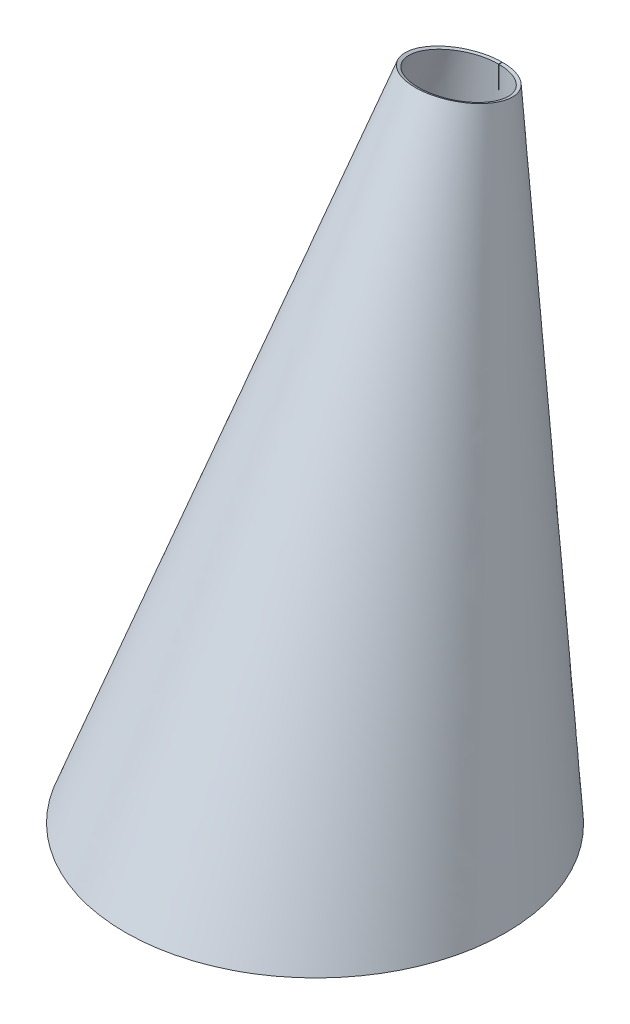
ISO-10303-21;
HEADER;
FILE_DESCRIPTION(('STEP AP214'),'2;1');
FILE_NAME('part.step','',(''),(''),'','','');
FILE_SCHEMA(('AUTOMOTIVE_DESIGN { 1 0 10303 214 1 1 1 1 }'));
ENDSEC;
DATA;
#1=APPLICATION_CONTEXT('core data for automotive mechanical design processes');
#2=APPLICATION_PROTOCOL_DEFINITION('international standard','automotive_design',2000,#1);
#3=PRODUCT_CONTEXT('',#1,'mechanical');
#4=PRODUCT('Part','Part','',(#3));
#5=PRODUCT_RELATED_PRODUCT_CATEGORY('part','',(#4));
#6=PRODUCT_DEFINITION_FORMATION('','',#4);
#7=PRODUCT_DEFINITION_CONTEXT('part definition',#1,'design');
#8=PRODUCT_DEFINITION('design','',#6,#7);
#9=PRODUCT_DEFINITION_SHAPE('','',#8);
#10=(LENGTH_UNIT() NAMED_UNIT(*) SI_UNIT(.MILLI.,.METRE.));
#11=(NAMED_UNIT(*) PLANE_ANGLE_UNIT() SI_UNIT($,.RADIAN.));
#12=(NAMED_UNIT(*) SI_UNIT($,.STERADIAN.) SOLID_ANGLE_UNIT());
#13=UNCERTAINTY_MEASURE_WITH_UNIT(LENGTH_MEASURE(1.E-05),#10,'distance_accuracy_value','');
#14=(GEOMETRIC_REPRESENTATION_CONTEXT(3) GLOBAL_UNCERTAINTY_ASSIGNED_CONTEXT((#13)) GLOBAL_UNIT_ASSIGNED_CONTEXT((#10,
#11,#12)) REPRESENTATION_CONTEXT('',''));
#15=CARTESIAN_POINT('',(0.,0.,0.));
#16=DIRECTION('',(0.,0.,1.));
#17=DIRECTION('',(1.,0.,0.));
#18=AXIS2_PLACEMENT_3D('',#15,#16,#17);
#19=CARTESIAN_POINT('',(-0.0540382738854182,163.992376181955,-54.2539951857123));
#20=CARTESIAN_POINT('',(-0.413246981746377,163.99274074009,-54.2525429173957));
#21=CARTESIAN_POINT('',(-0.824933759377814,163.996652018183,-54.2368476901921));
#22=CARTESIAN_POINT('',(-1.52423294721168,164.013576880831,-54.1689604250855));
#23=CARTESIAN_POINT('',(-1.77511384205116,164.021080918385,-54.1388480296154));
#24=CARTESIAN_POINT('',(-2.17938341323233,164.036688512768,-54.0762373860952));
#25=CARTESIAN_POINT('',(-2.31880645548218,164.042615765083,-54.0524644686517));
#26=CARTESIAN_POINT('',(-2.60730918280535,164.05616117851,-53.9981285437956));
#27=CARTESIAN_POINT('',(-2.75698250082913,164.06381288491,-53.9674331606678));
#28=CARTESIAN_POINT('',(-3.21752730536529,164.089459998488,-53.8645247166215));
#29=CARTESIAN_POINT('',(-3.55012533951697,164.110574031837,-53.7797930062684));
#30=CARTESIAN_POINT('',(-4.08636079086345,164.151538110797,-53.6154323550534));
#31=CARTESIAN_POINT('',(-4.27134479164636,164.166740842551,-53.5544432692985));
#32=CARTESIAN_POINT('',(-4.65383323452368,164.200749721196,-53.4179827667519));
#33=CARTESIAN_POINT('',(-4.85080911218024,164.219500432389,-53.3427291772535));
#34=CARTESIAN_POINT('',(-5.46397954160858,164.282243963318,-53.0909075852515));
#35=CARTESIAN_POINT('',(-5.90332841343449,164.333087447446,-52.8868572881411));
#36=CARTESIAN_POINT('',(-6.83327982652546,164.459772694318,-52.378252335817));
#37=CARTESIAN_POINT('',(-7.32985873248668,164.536399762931,-52.0706204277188));
#38=CARTESIAN_POINT('',(-8.36258904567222,164.725956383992,-51.3092738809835));
#39=CARTESIAN_POINT('',(-8.90552034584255,164.8400868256,-50.8508423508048));
#40=CARTESIAN_POINT('',(-9.99423107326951,165.11969325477,-49.7271138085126));
#41=CARTESIAN_POINT('',(-10.54649114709,165.286788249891,-49.055427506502));
#42=CARTESIAN_POINT('',(-11.5690932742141,165.689153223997,-47.4369163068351));
#43=CARTESIAN_POINT('',(-12.0434120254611,165.926112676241,-46.4833715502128));
#44=CARTESIAN_POINT('',(-12.5727526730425,166.340166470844,-44.8158499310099));
#45=CARTESIAN_POINT('',(-12.7183183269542,166.48792673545,-44.22058359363));
#46=CARTESIAN_POINT('',(-12.9197421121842,166.801607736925,-42.9563788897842));
#47=CARTESIAN_POINT('',(-12.975463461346,166.967468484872,-42.2876805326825));
#48=CARTESIAN_POINT('',(-12.9669596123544,167.313665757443,-40.8913237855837));
#49=CARTESIAN_POINT('',(-12.9025914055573,167.493725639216,-40.1647815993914));
#50=CARTESIAN_POINT('',(-12.6260082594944,167.861439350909,-38.6804020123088));
#51=CARTESIAN_POINT('',(-12.413988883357,168.048564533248,-37.9247105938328));
#52=CARTESIAN_POINT('',(-11.823572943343,168.420284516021,-36.4228946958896));
#53=CARTESIAN_POINT('',(-11.4461369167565,168.604128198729,-35.6798368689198));
#54=CARTESIAN_POINT('',(-10.5233532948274,168.956923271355,-34.2533357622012));
#55=CARTESIAN_POINT('',(-9.98004551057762,169.125013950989,-33.5734255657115));
#56=CARTESIAN_POINT('',(-8.74592580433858,169.43385548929,-32.3237553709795));
#57=CARTESIAN_POINT('',(-8.05819898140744,169.573806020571,-31.7572969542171));
#58=CARTESIAN_POINT('',(-6.57651690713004,169.816563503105,-30.7744542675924));
#59=CARTESIAN_POINT('',(-5.78621496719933,169.918785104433,-30.3604962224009));
#60=CARTESIAN_POINT('',(-4.15361911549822,170.081121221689,-29.7029802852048));
#61=CARTESIAN_POINT('',(-3.31480572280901,170.140930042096,-29.4606968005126));
#62=CARTESIAN_POINT('',(-1.64063522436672,170.219009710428,-29.144372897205));
#63=CARTESIAN_POINT('',(-0.808164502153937,170.237209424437,-29.0706349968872));
#64=CARTESIAN_POINT('',(0.808164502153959,170.237209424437,-29.0706349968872));
#65=CARTESIAN_POINT('',(1.6404313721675,170.21901897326,-29.1443342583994));
#66=CARTESIAN_POINT('',(3.31500957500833,170.140920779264,-29.4607354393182));
#67=CARTESIAN_POINT('',(4.1534941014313,170.081133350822,-29.7029297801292));
#68=CARTESIAN_POINT('',(5.78633998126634,169.9187729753,-30.3605467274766));
#69=CARTESIAN_POINT('',(6.57649621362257,169.816566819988,-30.7744404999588));
#70=CARTESIAN_POINT('',(8.05821967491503,169.573802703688,-31.7573107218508));
#71=CARTESIAN_POINT('',(8.74598979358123,169.433839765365,-32.3238203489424));
#72=CARTESIAN_POINT('',(9.97998152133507,169.125029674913,-33.5733605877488));
#73=CARTESIAN_POINT('',(10.5234505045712,168.956886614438,-34.253486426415));
#74=CARTESIAN_POINT('',(11.4460397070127,168.604164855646,-35.6796862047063));
#75=CARTESIAN_POINT('',(11.8236532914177,168.420234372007,-36.4230995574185));
#76=CARTESIAN_POINT('',(12.4139085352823,168.048614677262,-37.924505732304));
#77=CARTESIAN_POINT('',(12.6260475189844,167.861387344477,-38.6806131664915));
#78=CARTESIAN_POINT('',(12.9025521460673,167.493777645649,-40.1645704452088));
#79=CARTESIAN_POINT('',(12.9669606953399,167.313621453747,-40.8915025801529));
#80=CARTESIAN_POINT('',(12.9754623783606,166.967512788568,-42.2875017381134));
#81=CARTESIAN_POINT('',(12.9197216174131,166.801575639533,-42.9565076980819));
#82=CARTESIAN_POINT('',(12.7183388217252,166.487958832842,-44.2204547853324));
#83=CARTESIAN_POINT('',(12.572579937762,166.340030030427,-44.8163947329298));
#84=CARTESIAN_POINT('',(12.0437574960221,165.926385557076,-46.4822819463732));
#85=CARTESIAN_POINT('',(11.5689233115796,165.68908525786,-47.4371855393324));
#86=CARTESIAN_POINT('',(10.5466611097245,165.286856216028,-49.0551582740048));
#87=CARTESIAN_POINT('',(9.9943511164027,165.119724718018,-49.726989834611));
#88=CARTESIAN_POINT('',(8.90540030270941,164.840055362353,-50.8509663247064));
#89=CARTESIAN_POINT('',(8.36284268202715,164.726004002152,-51.3090868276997));
#90=CARTESIAN_POINT('',(7.32960509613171,164.536352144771,-52.0708074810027));
#91=CARTESIAN_POINT('',(6.83355007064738,164.459810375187,-52.3781045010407));
#92=CARTESIAN_POINT('',(6.13568114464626,164.364739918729,-52.7597799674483));
#93=CARTESIAN_POINT('',(5.90962887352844,164.336191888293,-52.8743823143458));
#94=CARTESIAN_POINT('',(5.4715825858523,164.284486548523,-53.0819165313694));
#95=CARTESIAN_POINT('',(5.25906083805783,164.261274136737,-53.1750652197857));
#96=CARTESIAN_POINT('',(4.64747608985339,164.198696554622,-53.4262355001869));
#97=CARTESIAN_POINT('',(4.26510594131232,164.165192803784,-53.560645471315));
#98=CARTESIAN_POINT('',(3.72887048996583,164.124228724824,-53.7250061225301));
#99=CARTESIAN_POINT('',(3.55636466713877,164.112121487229,-53.7735905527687));
#100=CARTESIAN_POINT('',(3.22393530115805,164.090462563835,-53.8605009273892));
#101=CARTESIAN_POINT('',(3.06460595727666,164.080944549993,-53.8986948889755));
#102=CARTESIAN_POINT('',(2.29406334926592,164.038031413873,-54.0708721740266));
#103=CARTESIAN_POINT('',(1.75868984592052,164.019251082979,-54.1461995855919));
#104=CARTESIAN_POINT('',(0.823576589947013,163.996619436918,-54.2369794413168));
#105=CARTESIAN_POINT('',(0.41426669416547,163.992741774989,-54.2525387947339));
#106=CARTESIAN_POINT('',(0.0540382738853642,163.992376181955,-54.2539951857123));
#107=CARTESIAN_POINT('',(-0.0499999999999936,163.987827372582,-53.2540136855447));
#108=CARTESIAN_POINT('',(-0.384718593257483,163.988164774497,-53.2526604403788));
#109=CARTESIAN_POINT('',(-0.760710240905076,163.991720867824,-53.2383977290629));
#110=CARTESIAN_POINT('',(-1.41161534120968,164.007475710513,-53.175208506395));
#111=CARTESIAN_POINT('',(-1.64308010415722,164.014408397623,-53.147403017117));
#112=CARTESIAN_POINT('',(-2.0162558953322,164.02881832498,-53.0896079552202));
#113=CARTESIAN_POINT('',(-2.14497760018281,164.034290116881,-53.0676617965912));
#114=CARTESIAN_POINT('',(-2.41178623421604,164.046818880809,-53.0174116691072));
#115=CARTESIAN_POINT('',(-2.54987316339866,164.053875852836,-52.989107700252));
#116=CARTESIAN_POINT('',(-2.97924030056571,164.07779686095,-52.8931657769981));
#117=CARTESIAN_POINT('',(-3.28586835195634,164.097286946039,-52.8149953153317));
#118=CARTESIAN_POINT('',(-3.78057652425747,164.135093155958,-52.6633628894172));
#119=CARTESIAN_POINT('',(-3.95127359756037,164.149123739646,-52.6070892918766));
#120=CARTESIAN_POINT('',(-4.30495496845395,164.180584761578,-52.4809060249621));
#121=CARTESIAN_POINT('',(-4.48793926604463,164.198015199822,-52.4109963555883));
#122=CARTESIAN_POINT('',(-5.05637078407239,164.256220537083,-52.1775474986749));
#123=CARTESIAN_POINT('',(-5.46127920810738,164.30309976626,-51.989525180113));
#124=CARTESIAN_POINT('',(-6.32347527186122,164.420671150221,-51.5179721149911));
#125=CARTESIAN_POINT('',(-6.78107792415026,164.491340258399,-51.2345338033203));
#126=CARTESIAN_POINT('',(-7.73854072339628,164.667334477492,-50.5286595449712));
#127=CARTESIAN_POINT('',(-8.23898559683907,164.772676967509,-50.1061538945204));
#128=CARTESIAN_POINT('',(-9.24803264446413,165.03236761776,-49.0645915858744));
#129=CARTESIAN_POINT('',(-9.75750644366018,165.186869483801,-48.4449184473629));
#130=CARTESIAN_POINT('',(-10.7044830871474,165.560625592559,-46.9458645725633));
#131=CARTESIAN_POINT('',(-11.1426089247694,165.780336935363,-46.0646505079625));
#132=CARTESIAN_POINT('',(-11.6320268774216,166.164961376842,-44.5220061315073));
#133=CARTESIAN_POINT('',(-11.7665497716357,166.302245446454,-43.9713898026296));
#134=CARTESIAN_POINT('',(-11.9525492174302,166.593761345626,-42.8021833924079));
#135=CARTESIAN_POINT('',(-12.0039133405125,166.748017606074,-42.1834953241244));
#136=CARTESIAN_POINT('',(-11.9956205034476,167.069899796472,-40.8924963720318));
#137=CARTESIAN_POINT('',(-11.9357740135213,167.237537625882,-40.2201377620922));
#138=CARTESIAN_POINT('',(-11.6795342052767,167.57958451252,-38.8482626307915));
#139=CARTESIAN_POINT('',(-11.4829035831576,167.75397804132,-38.1488083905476));
#140=CARTESIAN_POINT('',(-10.9365875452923,168.099914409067,-36.7613334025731));
#141=CARTESIAN_POINT('',(-10.5866997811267,168.271404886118,-36.0735226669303));
#142=CARTESIAN_POINT('',(-9.7333453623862,168.599884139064,-34.7560643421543));
#143=CARTESIAN_POINT('',(-9.22982242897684,168.756791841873,-34.1267419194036));
#144=CARTESIAN_POINT('',(-8.08896232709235,169.044480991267,-32.9728837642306));
#145=CARTESIAN_POINT('',(-7.45178207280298,169.175181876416,-32.4486711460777));
#146=CARTESIAN_POINT('',(-6.08232182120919,169.401413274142,-31.5413065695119));
#147=CARTESIAN_POINT('',(-5.35036836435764,169.4968992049,-31.1583334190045));
#148=CARTESIAN_POINT('',(-3.84148626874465,169.648244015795,-30.5513225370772));
#149=CARTESIAN_POINT('',(-3.06491450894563,169.704111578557,-30.3272499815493));
#150=CARTESIAN_POINT('',(-1.51749091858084,169.776928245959,-30.0351982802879));
#151=CARTESIAN_POINT('',(-0.746886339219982,169.793927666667,-29.9670173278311));
#152=CARTESIAN_POINT('',(0.746886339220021,169.793927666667,-29.9670173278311));
#153=CARTESIAN_POINT('',(1.51749091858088,169.776928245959,-30.0351982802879));
#154=CARTESIAN_POINT('',(3.06491450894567,169.704111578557,-30.3272499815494));
#155=CARTESIAN_POINT('',(3.8414862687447,169.648244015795,-30.5513225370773));
#156=CARTESIAN_POINT('',(5.35036836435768,169.4968992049,-31.1583334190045));
#157=CARTESIAN_POINT('',(6.08232182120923,169.401413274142,-31.5413065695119));
#158=CARTESIAN_POINT('',(7.45178207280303,169.175181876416,-32.4486711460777));
#159=CARTESIAN_POINT('',(8.08896232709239,169.044480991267,-32.9728837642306));
#160=CARTESIAN_POINT('',(9.22982242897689,168.756791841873,-34.1267419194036));
#161=CARTESIAN_POINT('',(9.73334536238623,168.599884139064,-34.7560643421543));
#162=CARTESIAN_POINT('',(10.5866997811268,168.271404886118,-36.0735226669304));
#163=CARTESIAN_POINT('',(10.9365875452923,168.099914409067,-36.7613334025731));
#164=CARTESIAN_POINT('',(11.4829035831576,167.75397804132,-38.1488083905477));
#165=CARTESIAN_POINT('',(11.6795342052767,167.57958451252,-38.8482626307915));
#166=CARTESIAN_POINT('',(11.9357740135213,167.237537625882,-40.2201377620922));
#167=CARTESIAN_POINT('',(11.9956205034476,167.069899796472,-40.8924963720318));
#168=CARTESIAN_POINT('',(12.0039133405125,166.748017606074,-42.1834953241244));
#169=CARTESIAN_POINT('',(11.9525492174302,166.593761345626,-42.802183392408));
#170=CARTESIAN_POINT('',(11.7665497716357,166.302245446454,-43.9713898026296));
#171=CARTESIAN_POINT('',(11.6320268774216,166.164961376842,-44.5220061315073));
#172=CARTESIAN_POINT('',(11.1426089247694,165.780336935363,-46.0646505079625));
#173=CARTESIAN_POINT('',(10.7044830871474,165.560625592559,-46.9458645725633));
#174=CARTESIAN_POINT('',(9.75750644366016,165.186869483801,-48.4449184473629));
#175=CARTESIAN_POINT('',(9.24803264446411,165.03236761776,-49.0645915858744));
#176=CARTESIAN_POINT('',(8.23898559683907,164.772676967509,-50.1061538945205));
#177=CARTESIAN_POINT('',(7.73854072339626,164.667334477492,-50.5286595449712));
#178=CARTESIAN_POINT('',(6.78107792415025,164.491340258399,-51.2345338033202));
#179=CARTESIAN_POINT('',(6.3234752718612,164.420671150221,-51.5179721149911));
#180=CARTESIAN_POINT('',(5.67682822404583,164.33249261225,-51.8716369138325));
#181=CARTESIAN_POINT('',(5.46782661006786,164.306076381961,-51.9775866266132));
#182=CARTESIAN_POINT('',(5.06285930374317,164.258239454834,-52.1694500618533));
#183=CARTESIAN_POINT('',(4.86689361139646,164.236818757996,-52.2553637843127));
#184=CARTESIAN_POINT('',(4.2984620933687,164.178613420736,-52.4888126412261));
#185=CARTESIAN_POINT('',(3.94547924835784,164.147695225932,-52.6128187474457));
#186=CARTESIAN_POINT('',(3.45077107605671,164.109889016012,-52.7644511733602));
#187=CARTESIAN_POINT('',(3.29166270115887,164.098715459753,-52.8092658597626));
#188=CARTESIAN_POINT('',(2.98433612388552,164.078682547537,-52.8896134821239));
#189=CARTESIAN_POINT('',(2.83611792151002,164.069823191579,-52.9251464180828));
#190=CARTESIAN_POINT('',(2.12050602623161,164.029954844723,-53.085049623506));
#191=CARTESIAN_POINT('',(1.6285837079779,164.012727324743,-53.1541454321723));
#192=CARTESIAN_POINT('',(0.760710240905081,163.991720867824,-53.2383977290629));
#193=CARTESIAN_POINT('',(0.384718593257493,163.988164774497,-53.2526604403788));
#194=CARTESIAN_POINT('',(0.0500000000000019,163.987827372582,-53.2540136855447));
#195=B_SPLINE_SURFACE_WITH_KNOTS('',1,3,((#19,#20,#21,#22,#23,#24,#25,#26,#27,#28,#29,#30,#31,
#32,#33,#34,#35,#36,#37,#38,#39,#40,#41,#42,#43,#44,#45,#46,#47,#48,#49,#50,#51,#52,#53,#54,#55,
#56,#57,#58,#59,#60,#61,#62,#63,#64,#65,#66,#67,#68,#69,#70,#71,#72,#73,#74,#75,#76,#77,#78,#79,
#80,#81,#82,#83,#84,#85,#86,#87,#88,#89,#90,#91,#92,#93,#94,#95,#96,#97,#98,#99,#100,#101,#102,
#103,#104,#105,#106),(#107,#108,#109,#110,#111,#112,#113,#114,#115,#116,#117,#118,#119,#120,
#121,#122,#123,#124,#125,#126,#127,#128,#129,#130,#131,#132,#133,#134,#135,#136,#137,#138,#139,
#140,#141,#142,#143,#144,#145,#146,#147,#148,#149,#150,#151,#152,#153,#154,#155,#156,#157,#158,
#159,#160,#161,#162,#163,#164,#165,#166,#167,#168,#169,#170,#171,#172,#173,#174,#175,#176,#177,
#178,#179,#180,#181,#182,#183,#184,#185,#186,#187,#188,#189,#190,#191,#192,#193,#194)),
.UNSPECIFIED.,.F.,.F.,.F.,(2,2),(4,2,2,2,2,2,2,2,2,2,2,2,2,2,2,2,2,2,2,2,2,2,2,2,2,2,2,2,2,2,2,
2,2,2,2,2,2,2,2,2,2,2,2,4),(0.,1.),(0.,0.0625,0.09375,0.109375,0.125,0.15625,0.171875,0.1875,
0.21875,0.25,0.28125,0.3125,0.34375,0.359375,0.375,0.390625,0.40625,0.421875,0.4375,0.453125,
0.46875,0.484375,0.5,0.515625,0.53125,0.546875,0.5625,0.578125,0.59375,0.609375,0.625,0.640625,
0.65625,0.6875,0.71875,0.75,0.78125,0.796875,0.8125,0.84375,0.859375,0.875,0.9375,1.),.UNSPECIFIED.);
#196=CARTESIAN_POINT('',(0.0500000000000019,163.987827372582,-53.2540136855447));
#197=CARTESIAN_POINT('',(0.0540382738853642,163.992376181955,-54.2539951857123));
#198=B_SPLINE_CURVE_WITH_KNOTS('',1,(#196,#197),.UNSPECIFIED.,.F.,.F.,(2,2),(0.,1.),.UNSPECIFIED.);
#199=CARTESIAN_POINT('',(0.0500000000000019,163.987827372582,-53.2540136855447));
#200=VERTEX_POINT('',#199);
#201=CARTESIAN_POINT('',(0.0540382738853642,163.992376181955,-54.2539951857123));
#202=VERTEX_POINT('',#201);
#203=EDGE_CURVE('E14',#200,#202,#198,.T.);
#204=CARTESIAN_POINT('',(0.0500000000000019,163.987827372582,-53.2540136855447));
#205=CARTESIAN_POINT('',(0.384718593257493,163.988164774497,-53.2526604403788));
#206=CARTESIAN_POINT('',(0.760710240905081,163.991720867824,-53.2383977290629));
#207=CARTESIAN_POINT('',(1.6285837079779,164.012727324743,-53.1541454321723));
#208=CARTESIAN_POINT('',(2.12050602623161,164.029954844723,-53.085049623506));
#209=CARTESIAN_POINT('',(2.83611792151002,164.069823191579,-52.9251464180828));
#210=CARTESIAN_POINT('',(2.98433612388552,164.078682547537,-52.8896134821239));
#211=CARTESIAN_POINT('',(3.29166270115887,164.098715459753,-52.8092658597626));
#212=CARTESIAN_POINT('',(3.45077107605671,164.109889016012,-52.7644511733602));
#213=CARTESIAN_POINT('',(3.94547924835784,164.147695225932,-52.6128187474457));
#214=CARTESIAN_POINT('',(4.2984620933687,164.178613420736,-52.4888126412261));
#215=CARTESIAN_POINT('',(4.86689361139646,164.236818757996,-52.2553637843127));
#216=CARTESIAN_POINT('',(5.06285930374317,164.258239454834,-52.1694500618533));
#217=CARTESIAN_POINT('',(5.46782661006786,164.306076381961,-51.9775866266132));
#218=CARTESIAN_POINT('',(5.67682822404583,164.33249261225,-51.8716369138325));
#219=CARTESIAN_POINT('',(6.3234752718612,164.420671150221,-51.5179721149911));
#220=CARTESIAN_POINT('',(6.78107792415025,164.491340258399,-51.2345338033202));
#221=CARTESIAN_POINT('',(7.73854072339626,164.667334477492,-50.5286595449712));
#222=CARTESIAN_POINT('',(8.23898559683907,164.772676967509,-50.1061538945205));
#223=CARTESIAN_POINT('',(9.24803264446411,165.03236761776,-49.0645915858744));
#224=CARTESIAN_POINT('',(9.75750644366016,165.186869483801,-48.4449184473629));
#225=CARTESIAN_POINT('',(10.7044830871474,165.560625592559,-46.9458645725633));
#226=CARTESIAN_POINT('',(11.1426089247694,165.780336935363,-46.0646505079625));
#227=CARTESIAN_POINT('',(11.6320268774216,166.164961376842,-44.5220061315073));
#228=CARTESIAN_POINT('',(11.7665497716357,166.302245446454,-43.9713898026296));
#229=CARTESIAN_POINT('',(11.9525492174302,166.593761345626,-42.802183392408));
#230=CARTESIAN_POINT('',(12.0039133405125,166.748017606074,-42.1834953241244));
#231=CARTESIAN_POINT('',(11.9956205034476,167.069899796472,-40.8924963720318));
#232=CARTESIAN_POINT('',(11.9357740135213,167.237537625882,-40.2201377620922));
#233=CARTESIAN_POINT('',(11.6795342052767,167.57958451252,-38.8482626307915));
#234=CARTESIAN_POINT('',(11.4829035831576,167.75397804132,-38.1488083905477));
#235=CARTESIAN_POINT('',(10.9365875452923,168.099914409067,-36.7613334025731));
#236=CARTESIAN_POINT('',(10.5866997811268,168.271404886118,-36.0735226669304));
#237=CARTESIAN_POINT('',(9.73334536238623,168.599884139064,-34.7560643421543));
#238=CARTESIAN_POINT('',(9.22982242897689,168.756791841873,-34.1267419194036));
#239=CARTESIAN_POINT('',(8.08896232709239,169.044480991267,-32.9728837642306));
#240=CARTESIAN_POINT('',(7.45178207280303,169.175181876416,-32.4486711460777));
#241=CARTESIAN_POINT('',(6.08232182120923,169.401413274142,-31.5413065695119));
#242=CARTESIAN_POINT('',(5.35036836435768,169.4968992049,-31.1583334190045));
#243=CARTESIAN_POINT('',(3.8414862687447,169.648244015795,-30.5513225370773));
#244=CARTESIAN_POINT('',(3.06491450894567,169.704111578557,-30.3272499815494));
#245=CARTESIAN_POINT('',(1.51749091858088,169.776928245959,-30.0351982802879));
#246=CARTESIAN_POINT('',(0.746886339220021,169.793927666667,-29.9670173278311));
#247=CARTESIAN_POINT('',(-0.746886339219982,169.793927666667,-29.9670173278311));
#248=CARTESIAN_POINT('',(-1.51749091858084,169.776928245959,-30.0351982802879));
#249=CARTESIAN_POINT('',(-3.06491450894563,169.704111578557,-30.3272499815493));
#250=CARTESIAN_POINT('',(-3.84148626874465,169.648244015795,-30.5513225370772));
#251=CARTESIAN_POINT('',(-5.35036836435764,169.4968992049,-31.1583334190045));
#252=CARTESIAN_POINT('',(-6.08232182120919,169.401413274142,-31.5413065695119));
#253=CARTESIAN_POINT('',(-7.45178207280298,169.175181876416,-32.4486711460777));
#254=CARTESIAN_POINT('',(-8.08896232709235,169.044480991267,-32.9728837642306));
#255=CARTESIAN_POINT('',(-9.22982242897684,168.756791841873,-34.1267419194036));
#256=CARTESIAN_POINT('',(-9.7333453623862,168.599884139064,-34.7560643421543));
#257=CARTESIAN_POINT('',(-10.5866997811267,168.271404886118,-36.0735226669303));
#258=CARTESIAN_POINT('',(-10.9365875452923,168.099914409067,-36.7613334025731));
#259=CARTESIAN_POINT('',(-11.4829035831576,167.75397804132,-38.1488083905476));
#260=CARTESIAN_POINT('',(-11.6795342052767,167.57958451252,-38.8482626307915));
#261=CARTESIAN_POINT('',(-11.9357740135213,167.237537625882,-40.2201377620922));
#262=CARTESIAN_POINT('',(-11.9956205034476,167.069899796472,-40.8924963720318));
#263=CARTESIAN_POINT('',(-12.0039133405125,166.748017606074,-42.1834953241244));
#264=CARTESIAN_POINT('',(-11.9525492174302,166.593761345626,-42.8021833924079));
#265=CARTESIAN_POINT('',(-11.7665497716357,166.302245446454,-43.9713898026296));
#266=CARTESIAN_POINT('',(-11.6320268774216,166.164961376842,-44.5220061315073));
#267=CARTESIAN_POINT('',(-11.1426089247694,165.780336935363,-46.0646505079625));
#268=CARTESIAN_POINT('',(-10.7044830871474,165.560625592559,-46.9458645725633));
#269=CARTESIAN_POINT('',(-9.75750644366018,165.186869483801,-48.4449184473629));
#270=CARTESIAN_POINT('',(-9.24803264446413,165.03236761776,-49.0645915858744));
#271=CARTESIAN_POINT('',(-8.23898559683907,164.772676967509,-50.1061538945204));
#272=CARTESIAN_POINT('',(-7.73854072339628,164.667334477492,-50.5286595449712));
#273=CARTESIAN_POINT('',(-6.78107792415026,164.491340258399,-51.2345338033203));
#274=CARTESIAN_POINT('',(-6.32347527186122,164.420671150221,-51.5179721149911));
#275=CARTESIAN_POINT('',(-5.46127920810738,164.30309976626,-51.989525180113));
#276=CARTESIAN_POINT('',(-5.05637078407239,164.256220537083,-52.1775474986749));
#277=CARTESIAN_POINT('',(-4.48793926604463,164.198015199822,-52.4109963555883));
#278=CARTESIAN_POINT('',(-4.30495496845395,164.180584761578,-52.4809060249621));
#279=CARTESIAN_POINT('',(-3.95127359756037,164.149123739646,-52.6070892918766));
#280=CARTESIAN_POINT('',(-3.78057652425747,164.135093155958,-52.6633628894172));
#281=CARTESIAN_POINT('',(-3.28586835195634,164.097286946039,-52.8149953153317));
#282=CARTESIAN_POINT('',(-2.97924030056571,164.07779686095,-52.8931657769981));
#283=CARTESIAN_POINT('',(-2.54987316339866,164.053875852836,-52.989107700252));
#284=CARTESIAN_POINT('',(-2.41178623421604,164.046818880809,-53.0174116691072));
#285=CARTESIAN_POINT('',(-2.14497760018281,164.034290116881,-53.0676617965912));
#286=CARTESIAN_POINT('',(-2.0162558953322,164.02881832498,-53.0896079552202));
#287=CARTESIAN_POINT('',(-1.64308010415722,164.014408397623,-53.147403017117));
#288=CARTESIAN_POINT('',(-1.41161534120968,164.007475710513,-53.175208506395));
#289=CARTESIAN_POINT('',(-0.760710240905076,163.991720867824,-53.2383977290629));
#290=CARTESIAN_POINT('',(-0.384718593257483,163.988164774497,-53.2526604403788));
#291=CARTESIAN_POINT('',(-0.0499999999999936,163.987827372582,-53.2540136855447));
#292=B_SPLINE_CURVE_WITH_KNOTS('',3,(#204,#205,#206,#207,#208,#209,#210,#211,#212,#213,#214,
#215,#216,#217,#218,#219,#220,#221,#222,#223,#224,#225,#226,#227,#228,#229,#230,#231,#232,#233,
#234,#235,#236,#237,#238,#239,#240,#241,#242,#243,#244,#245,#246,#247,#248,#249,#250,#251,#252,
#253,#254,#255,#256,#257,#258,#259,#260,#261,#262,#263,#264,#265,#266,#267,#268,#269,#270,#271,
#272,#273,#274,#275,#276,#277,#278,#279,#280,#281,#282,#283,#284,#285,#286,#287,#288,#289,#290,
#291),.UNSPECIFIED.,.F.,.F.,(4,2,2,2,2,2,2,2,2,2,2,2,2,2,2,2,2,2,2,2,2,2,2,2,2,2,2,2,2,2,2,2,2,
2,2,2,2,2,2,2,2,2,2,4),(0.,0.0625,0.125,0.140625,0.15625,0.1875,0.203125,0.21875,0.25,0.28125,
0.3125,0.34375,0.359375,0.375,0.390625,0.40625,0.421875,0.4375,0.453125,0.46875,0.484375,0.5,
0.515625,0.53125,0.546875,0.5625,0.578125,0.59375,0.609375,0.625,0.640625,0.65625,0.6875,
0.71875,0.75,0.78125,0.8125,0.828125,0.84375,0.875,0.890625,0.90625,0.9375,1.),.UNSPECIFIED.);
#293=CARTESIAN_POINT('',(-0.0499999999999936,163.987827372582,-53.2540136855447));
#294=VERTEX_POINT('',#293);
#295=EDGE_CURVE('E120',#200,#294,#292,.T.);
#296=CARTESIAN_POINT('',(-0.0499999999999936,163.987827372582,-53.2540136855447));
#297=CARTESIAN_POINT('',(-0.0540382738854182,163.992376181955,-54.2539951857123));
#298=B_SPLINE_CURVE_WITH_KNOTS('',1,(#296,#297),.UNSPECIFIED.,.F.,.F.,(2,2),(0.,1.),.UNSPECIFIED.);
#299=CARTESIAN_POINT('',(-0.0540382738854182,163.992376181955,-54.2539951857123));
#300=VERTEX_POINT('',#299);
#301=EDGE_CURVE('E69',#294,#300,#298,.T.);
#302=CARTESIAN_POINT('',(0.0540382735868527,163.992376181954,-54.2539951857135));
#303=CARTESIAN_POINT('',(0.24689401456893,163.992514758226,-54.2534559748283));
#304=CARTESIAN_POINT('',(0.439730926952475,163.993752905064,-54.2484931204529));
#305=CARTESIAN_POINT('',(0.852318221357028,163.998658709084,-54.2288116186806));
#306=CARTESIAN_POINT('',(1.0720048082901,164.00264617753,-54.2128085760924));
#307=CARTESIAN_POINT('',(1.41235266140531,164.010861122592,-54.1798513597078));
#308=CARTESIAN_POINT('',(1.53340130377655,164.014185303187,-54.1665170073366));
#309=CARTESIAN_POINT('',(1.78464114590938,164.021958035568,-54.1353334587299));
#310=CARTESIAN_POINT('',(1.91479670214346,164.026474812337,-54.1172102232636));
#311=CARTESIAN_POINT('',(2.18450556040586,164.036885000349,-54.0754490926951));
#312=CARTESIAN_POINT('',(2.32400654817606,164.042857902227,-54.051492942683));
#313=CARTESIAN_POINT('',(2.61273941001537,164.056418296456,-53.9970973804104));
#314=CARTESIAN_POINT('',(2.76189989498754,164.064094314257,-53.966302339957));
#315=CARTESIAN_POINT('',(3.07109436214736,164.081297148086,-53.8972796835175));
#316=CARTESIAN_POINT('',(3.23103375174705,164.090923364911,-53.8586526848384));
#317=CARTESIAN_POINT('',(3.56368244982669,164.112600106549,-53.7716691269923));
#318=CARTESIAN_POINT('',(3.73623584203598,164.124791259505,-53.7227481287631));
#319=CARTESIAN_POINT('',(4.09404460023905,164.152125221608,-53.6130776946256));
#320=CARTESIAN_POINT('',(4.27908480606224,164.167433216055,-53.5516668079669));
#321=CARTESIAN_POINT('',(4.66198721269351,164.201470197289,-53.4150900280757));
#322=CARTESIAN_POINT('',(4.85957181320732,164.220380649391,-53.3391934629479));
#323=CARTESIAN_POINT('',(5.26950829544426,164.262362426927,-53.1707055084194));
#324=CARTESIAN_POINT('',(5.48146853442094,164.285658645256,-53.0772119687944));
#325=CARTESIAN_POINT('',(5.80267525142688,164.323564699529,-52.9250651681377));
#326=CARTESIAN_POINT('',(5.91393412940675,164.337187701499,-52.8703817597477));
#327=CARTESIAN_POINT('',(6.13993280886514,164.365857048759,-52.7552934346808));
#328=CARTESIAN_POINT('',(6.25459274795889,164.380940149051,-52.6947406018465));
#329=CARTESIAN_POINT('',(6.48752721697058,164.412670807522,-52.5673548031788));
#330=CARTESIAN_POINT('',(6.60570756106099,164.429358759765,-52.5003596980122));
#331=CARTESIAN_POINT('',(6.84575622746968,164.464502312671,-52.3592684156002));
#332=CARTESIAN_POINT('',(6.96750742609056,164.483004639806,-52.2849844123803));
#333=CARTESIAN_POINT('',(7.21435671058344,164.521931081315,-52.1286862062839));
#334=CARTESIAN_POINT('',(7.33931989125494,164.54240501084,-52.0464712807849));
#335=CARTESIAN_POINT('',(7.59227172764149,164.585428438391,-51.8736929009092));
#336=CARTESIAN_POINT('',(7.72010676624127,164.608030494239,-51.7829177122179));
#337=CARTESIAN_POINT('',(7.97879380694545,164.65551000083,-51.5922197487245));
#338=CARTESIAN_POINT('',(8.10946551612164,164.680444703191,-51.4920665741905));
#339=CARTESIAN_POINT('',(8.37355768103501,164.732869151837,-51.2814842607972));
#340=CARTESIAN_POINT('',(8.50675546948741,164.760424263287,-51.1707918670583));
#341=CARTESIAN_POINT('',(8.77513905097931,164.818291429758,-50.9383190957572));
#342=CARTESIAN_POINT('',(8.91006987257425,164.848672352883,-50.8162613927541));
#343=CARTESIAN_POINT('',(9.18118639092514,164.912383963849,-50.5602653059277));
#344=CARTESIAN_POINT('',(9.31708294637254,164.945786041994,-50.4260385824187));
#345=CARTESIAN_POINT('',(9.58974122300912,165.015810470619,-50.144617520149));
#346=CARTESIAN_POINT('',(9.72616351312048,165.052509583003,-49.9971132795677));
#347=CARTESIAN_POINT('',(9.99887531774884,165.129457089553,-49.6878103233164));
#348=CARTESIAN_POINT('',(10.1347545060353,165.169789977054,-49.5256704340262));
#349=CARTESIAN_POINT('',(10.4048668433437,165.254216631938,-49.1862404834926));
#350=CARTESIAN_POINT('',(10.5386359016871,165.298396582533,-49.0086023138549));
#351=CARTESIAN_POINT('',(10.8030536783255,165.390712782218,-48.6373646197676));
#352=CARTESIAN_POINT('',(10.9331804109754,165.438935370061,-48.4434151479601));
#353=CARTESIAN_POINT('',(11.1891247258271,165.539650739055,-48.0382907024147));
#354=CARTESIAN_POINT('',(11.3143313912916,165.592233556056,-47.8267508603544));
#355=CARTESIAN_POINT('',(11.4948299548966,165.673410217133,-47.500133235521));
#356=CARTESIAN_POINT('',(11.55483560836,165.701404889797,-47.387487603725));
#357=CARTESIAN_POINT('',(11.6727934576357,165.758542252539,-47.1575604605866));
#358=CARTESIAN_POINT('',(11.730653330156,165.787695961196,-47.0402341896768));
#359=CARTESIAN_POINT('',(11.8439845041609,165.847161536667,-46.8009044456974));
#360=CARTESIAN_POINT('',(11.8993586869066,165.877484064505,-46.6788576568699));
#361=CARTESIAN_POINT('',(12.0073907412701,165.939296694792,-46.4300450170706));
#362=CARTESIAN_POINT('',(12.0599465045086,165.970797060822,-46.3032373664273));
#363=CARTESIAN_POINT('',(12.1620112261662,166.034973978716,-46.0448655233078));
#364=CARTESIAN_POINT('',(12.2114126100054,166.067660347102,-45.9132612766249));
#365=CARTESIAN_POINT('',(12.3068529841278,166.134215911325,-45.6452661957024));
#366=CARTESIAN_POINT('',(12.3527788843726,166.168094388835,-45.508837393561));
#367=CARTESIAN_POINT('',(12.4409557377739,166.237081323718,-45.2310050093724));
#368=CARTESIAN_POINT('',(12.4830813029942,166.272198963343,-45.0895638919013));
#369=CARTESIAN_POINT('',(12.563154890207,166.343625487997,-44.8018581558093));
#370=CARTESIAN_POINT('',(12.6009756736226,166.379942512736,-44.6555601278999));
#371=CARTESIAN_POINT('',(12.6720143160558,166.453745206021,-44.3582293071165));
#372=CARTESIAN_POINT('',(12.7051006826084,166.491238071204,-44.2071668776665));
#373=CARTESIAN_POINT('',(12.7662354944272,166.567369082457,-43.9003990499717));
#374=CARTESIAN_POINT('',(12.7941473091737,166.606013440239,-43.7446679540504));
#375=CARTESIAN_POINT('',(12.8444956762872,166.684428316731,-43.4286379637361));
#376=CARTESIAN_POINT('',(12.86678874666,166.724204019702,-43.2683174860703));
#377=CARTESIAN_POINT('',(12.9054270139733,166.804825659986,-42.9433314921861));
#378=CARTESIAN_POINT('',(12.9216265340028,166.845675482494,-42.7786496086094));
#379=CARTESIAN_POINT('',(12.9476136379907,166.928387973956,-42.4451701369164));
#380=CARTESIAN_POINT('',(12.9572525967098,166.970253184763,-42.2763615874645));
#381=CARTESIAN_POINT('',(12.9696550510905,167.054937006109,-41.9348663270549));
#382=CARTESIAN_POINT('',(12.9722661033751,167.097756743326,-41.7621743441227));
#383=CARTESIAN_POINT('',(12.9701346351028,167.184284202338,-41.4131728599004));
#384=CARTESIAN_POINT('',(12.9652351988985,167.227991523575,-41.2368642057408));
#385=CARTESIAN_POINT('',(12.9476421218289,167.316181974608,-40.8810814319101));
#386=CARTESIAN_POINT('',(12.9347947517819,167.360663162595,-40.701614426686));
#387=CARTESIAN_POINT('',(12.9008805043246,167.450300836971,-40.339919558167));
#388=CARTESIAN_POINT('',(12.8796598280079,167.495453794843,-40.1577052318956));
#389=CARTESIAN_POINT('',(12.8285725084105,167.586331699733,-39.7909306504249));
#390=CARTESIAN_POINT('',(12.7985508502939,167.63205144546,-39.6063906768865));
#391=CARTESIAN_POINT('',(12.7294277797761,167.723939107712,-39.2354603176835));
#392=CARTESIAN_POINT('',(12.6901716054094,167.770100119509,-39.0490970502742));
#393=CARTESIAN_POINT('',(12.6022903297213,167.862699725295,-38.6752123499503));
#394=CARTESIAN_POINT('',(12.5535208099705,167.909130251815,-38.4877228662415));
#395=CARTESIAN_POINT('',(12.4463248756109,168.002126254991,-38.1121621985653));
#396=CARTESIAN_POINT('',(12.3877577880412,168.048682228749,-37.924128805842));
#397=CARTESIAN_POINT('',(12.2606747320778,168.141782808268,-37.5480694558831));
#398=CARTESIAN_POINT('',(12.1920204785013,168.188316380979,-37.3600874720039));
#399=CARTESIAN_POINT('',(12.044498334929,168.281189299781,-36.9848649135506));
#400=CARTESIAN_POINT('',(11.9654989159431,168.327516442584,-36.7976730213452));
#401=CARTESIAN_POINT('',(11.7972819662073,168.419763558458,-36.4248998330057));
#402=CARTESIAN_POINT('',(11.7079500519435,168.465671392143,-36.2393671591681));
#403=CARTESIAN_POINT('',(11.519021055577,168.556910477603,-35.8705990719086));
#404=CARTESIAN_POINT('',(11.4193167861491,168.602228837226,-35.6874153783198));
#405=CARTESIAN_POINT('',(11.2095882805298,168.692114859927,-35.3240471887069));
#406=CARTESIAN_POINT('',(11.0994626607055,168.736668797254,-35.1439177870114));
#407=CARTESIAN_POINT('',(10.868928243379,168.824802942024,-34.7875555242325));
#408=CARTESIAN_POINT('',(10.7484310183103,168.868369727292,-34.6113765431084));
#409=CARTESIAN_POINT('',(10.4975238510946,168.954310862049,-34.2638131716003));
#410=CARTESIAN_POINT('',(10.3670459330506,168.996673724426,-34.0924750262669));
#411=CARTESIAN_POINT('',(10.0964353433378,169.080041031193,-33.7552678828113));
#412=CARTESIAN_POINT('',(9.95624320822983,169.121034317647,-33.5894438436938));
#413=CARTESIAN_POINT('',(9.66645074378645,169.201490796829,-33.263957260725));
#414=CARTESIAN_POINT('',(9.51679827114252,169.240943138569,-33.1043384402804));
#415=CARTESIAN_POINT('',(9.20850301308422,169.318093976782,-32.7921640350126));
#416=CARTESIAN_POINT('',(9.04982390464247,169.355784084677,-32.6396422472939));
#417=CARTESIAN_POINT('',(8.72420770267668,169.429233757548,-32.3423931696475));
#418=CARTESIAN_POINT('',(8.55725233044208,169.464988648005,-32.1976847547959));
#419=CARTESIAN_POINT('',(8.21562846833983,169.534442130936,-31.9165753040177));
#420=CARTESIAN_POINT('',(8.04094831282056,169.568137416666,-31.7801876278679));
#421=CARTESIAN_POINT('',(7.68440593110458,169.63333961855,-31.5162518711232));
#422=CARTESIAN_POINT('',(7.5025378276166,169.664844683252,-31.3887112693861));
#423=CARTESIAN_POINT('',(7.13238722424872,169.725490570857,-31.1431786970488));
#424=CARTESIAN_POINT('',(6.94411220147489,169.754634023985,-31.0251761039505));
#425=CARTESIAN_POINT('',(6.56210759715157,169.81046155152,-30.7991202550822));
#426=CARTESIAN_POINT('',(6.36839614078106,169.837152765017,-30.6910381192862));
#427=CARTESIAN_POINT('',(5.97624227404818,169.888018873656,-30.4850576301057));
#428=CARTESIAN_POINT('',(5.77782013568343,169.912202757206,-30.3871229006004));
#429=CARTESIAN_POINT('',(5.37695406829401,169.957991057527,-30.2016905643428));
#430=CARTESIAN_POINT('',(5.17453210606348,169.979606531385,-30.1141482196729));
#431=CARTESIAN_POINT('',(4.76663417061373,170.020167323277,-29.9498648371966));
#432=CARTESIAN_POINT('',(4.56118666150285,170.039129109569,-29.8730571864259));
#433=CARTESIAN_POINT('',(4.14821949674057,170.074382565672,-29.7302551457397));
#434=CARTESIAN_POINT('',(3.94073010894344,170.090694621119,-29.6641782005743));
#435=CARTESIAN_POINT('',(3.52442434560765,170.120668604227,-29.5427597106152));
#436=CARTESIAN_POINT('',(3.3156354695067,170.134352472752,-29.4873292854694));
#437=CARTESIAN_POINT('',(2.89746219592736,170.15908478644,-29.3871421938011));
#438=CARTESIAN_POINT('',(2.68810232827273,170.17015704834,-29.3422890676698));
#439=CARTESIAN_POINT('',(2.26974701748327,170.189670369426,-29.2632357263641));
#440=CARTESIAN_POINT('',(2.06077483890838,170.19814009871,-29.2289194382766));
#441=CARTESIAN_POINT('',(1.64401121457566,170.21252786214,-29.1706254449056));
#442=CARTESIAN_POINT('',(1.43623837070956,170.218476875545,-29.1465222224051));
#443=CARTESIAN_POINT('',(1.02249889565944,170.227906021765,-29.1083205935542));
#444=CARTESIAN_POINT('',(0.816544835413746,170.231417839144,-29.094093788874));
#445=CARTESIAN_POINT('',(0.407056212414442,170.236053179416,-29.075317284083));
#446=CARTESIAN_POINT('',(0.203528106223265,170.237209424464,-29.070634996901));
#447=CARTESIAN_POINT('',(-0.203528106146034,170.237209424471,-29.0706349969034));
#448=CARTESIAN_POINT('',(-0.407056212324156,170.236053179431,-29.0753172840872));
#449=CARTESIAN_POINT('',(-0.816544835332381,170.231417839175,-29.0940937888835));
#450=CARTESIAN_POINT('',(-1.02249889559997,170.227906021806,-29.1083205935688));
#451=CARTESIAN_POINT('',(-1.43623837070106,170.218476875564,-29.1465222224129));
#452=CARTESIAN_POINT('',(-1.64401121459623,170.212527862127,-29.1706254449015));
#453=CARTESIAN_POINT('',(-2.06077483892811,170.198140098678,-29.2289194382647));
#454=CARTESIAN_POINT('',(-2.26974701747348,170.189670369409,-29.263235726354));
#455=CARTESIAN_POINT('',(-2.68810232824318,170.170157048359,-29.3422890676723));
#456=CARTESIAN_POINT('',(-2.89746219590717,170.159084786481,-29.3871421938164));
#457=CARTESIAN_POINT('',(-3.31563546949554,170.134352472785,-29.4873292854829));
#458=CARTESIAN_POINT('',(-3.52442434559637,170.120668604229,-29.5427597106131));
#459=CARTESIAN_POINT('',(-3.94073010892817,170.090694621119,-29.6641782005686));
#460=CARTESIAN_POINT('',(-4.1482194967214,170.074382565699,-29.7302551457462));
#461=CARTESIAN_POINT('',(-4.56118666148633,170.039129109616,-29.8730571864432));
#462=CARTESIAN_POINT('',(-4.76663417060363,170.020167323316,-29.9498648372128));
#463=CARTESIAN_POINT('',(-5.17453210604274,169.979606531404,-30.1141482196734));
#464=CARTESIAN_POINT('',(-5.37695406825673,169.957991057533,-30.2016905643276));
#465=CARTESIAN_POINT('',(-5.77782013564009,169.912202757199,-30.387122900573));
#466=CARTESIAN_POINT('',(-5.97624227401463,169.88801887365,-30.4850576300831));
#467=CARTESIAN_POINT('',(-6.36839614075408,169.837152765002,-30.6910381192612));
#468=CARTESIAN_POINT('',(-6.56210759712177,169.810461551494,-30.7991202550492));
#469=CARTESIAN_POINT('',(-6.94411220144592,169.75463402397,-31.0251761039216));
#470=CARTESIAN_POINT('',(-7.13238722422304,169.725490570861,-31.1431786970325));
#471=CARTESIAN_POINT('',(-7.50253782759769,169.664844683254,-31.3887112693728));
#472=CARTESIAN_POINT('',(-7.68440593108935,169.63333961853,-31.5162518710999));
#473=CARTESIAN_POINT('',(-8.04094831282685,169.568137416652,-31.7801876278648));
#474=CARTESIAN_POINT('',(-8.2156284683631,169.534442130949,-31.916575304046));
#475=CARTESIAN_POINT('',(-8.55725233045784,169.464988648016,-32.1976847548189));
#476=CARTESIAN_POINT('',(-8.72420770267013,169.42923375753,-32.3423931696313));
#477=CARTESIAN_POINT('',(-9.04982390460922,169.355784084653,-32.6396422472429));
#478=CARTESIAN_POINT('',(-9.20850301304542,169.318093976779,-32.792164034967));
#479=CARTESIAN_POINT('',(-9.51679827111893,169.240943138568,-33.1043384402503));
#480=CARTESIAN_POINT('',(-9.66645074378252,169.201490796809,-33.2639572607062));
#481=CARTESIAN_POINT('',(-9.95624320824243,169.121034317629,-33.5894438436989));
#482=CARTESIAN_POINT('',(-10.0964353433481,169.080041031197,-33.7552678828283));
#483=CARTESIAN_POINT('',(-10.367045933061,168.996673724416,-34.0924750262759));
#484=CARTESIAN_POINT('',(-10.4975238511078,168.954310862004,-34.2638131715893));
#485=CARTESIAN_POINT('',(-10.7484310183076,168.86836972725,-34.6113765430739));
#486=CARTESIAN_POINT('',(-10.8689282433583,168.82480294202,-34.787555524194));
#487=CARTESIAN_POINT('',(-11.0994626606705,168.736668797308,-35.1439177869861));
#488=CARTESIAN_POINT('',(-11.209588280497,168.692114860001,-35.3240471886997));
#489=CARTESIAN_POINT('',(-11.4193167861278,168.602228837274,-35.6874153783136));
#490=CARTESIAN_POINT('',(-11.5190210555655,168.556910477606,-35.8705990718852));
#491=CARTESIAN_POINT('',(-11.7079500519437,168.465671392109,-36.2393671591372));
#492=CARTESIAN_POINT('',(-11.797281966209,168.419763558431,-36.4248998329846));
#493=CARTESIAN_POINT('',(-11.9654989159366,168.327516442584,-36.7976730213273));
#494=CARTESIAN_POINT('',(-12.0444983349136,168.281189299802,-36.9848649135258));
#495=CARTESIAN_POINT('',(-12.1920204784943,168.188316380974,-37.3600874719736));
#496=CARTESIAN_POINT('',(-12.2606747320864,168.141782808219,-37.548069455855));
#497=CARTESIAN_POINT('',(-12.3877577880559,168.048682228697,-37.9241288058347));
#498=CARTESIAN_POINT('',(-12.446324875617,168.002126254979,-38.1121621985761));
#499=CARTESIAN_POINT('',(-12.5535208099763,167.909130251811,-38.487722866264));
#500=CARTESIAN_POINT('',(-12.6022903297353,167.862699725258,-38.6752123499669));
#501=CARTESIAN_POINT('',(-12.6901716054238,167.770100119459,-39.0490970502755));
#502=CARTESIAN_POINT('',(-12.7294277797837,167.723939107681,-39.235460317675));
#503=CARTESIAN_POINT('',(-12.7985508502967,167.632051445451,-39.6063906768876));
#504=CARTESIAN_POINT('',(-12.8285725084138,167.586331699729,-39.7909306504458));
#505=CARTESIAN_POINT('',(-12.8796598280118,167.495453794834,-40.1577052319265));
#506=CARTESIAN_POINT('',(-12.9008805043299,167.450300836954,-40.3399195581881));
#507=CARTESIAN_POINT('',(-12.9347947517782,167.360663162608,-40.7016144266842));
#508=CARTESIAN_POINT('',(-12.9476421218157,167.316181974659,-40.8810814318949));
#509=CARTESIAN_POINT('',(-12.9652351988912,167.227991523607,-41.2368642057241));
#510=CARTESIAN_POINT('',(-12.9701346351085,167.184284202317,-41.4131728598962));
#511=CARTESIAN_POINT('',(-12.9722661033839,167.097756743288,-41.7621743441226));
#512=CARTESIAN_POINT('',(-12.9696550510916,167.054937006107,-41.9348663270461));
#513=CARTESIAN_POINT('',(-12.957252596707,166.97025318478,-42.2763615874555));
#514=CARTESIAN_POINT('',(-12.9476136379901,166.928387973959,-42.4451701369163));
#515=CARTESIAN_POINT('',(-12.9216265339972,166.845675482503,-42.7786496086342));
#516=CARTESIAN_POINT('',(-12.9054270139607,166.804825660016,-42.9433314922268));
#517=CARTESIAN_POINT('',(-12.8667887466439,166.724204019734,-43.2683174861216));
#518=CARTESIAN_POINT('',(-12.8444956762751,166.684428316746,-43.4286379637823));
#519=CARTESIAN_POINT('',(-12.7941473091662,166.606013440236,-43.7446679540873));
#520=CARTESIAN_POINT('',(-12.7662354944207,166.567369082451,-43.9003990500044));
#521=CARTESIAN_POINT('',(-12.7051006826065,166.491238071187,-44.2071668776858));
#522=CARTESIAN_POINT('',(-12.6720143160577,166.453745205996,-44.3582293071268));
#523=CARTESIAN_POINT('',(-12.6009756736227,166.379942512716,-44.655560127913));
#524=CARTESIAN_POINT('',(-12.5631548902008,166.343625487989,-44.801858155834));
#525=CARTESIAN_POINT('',(-12.4830813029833,166.272198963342,-45.0895638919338));
#526=CARTESIAN_POINT('',(-12.4409557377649,166.237081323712,-45.2310050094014));
#527=CARTESIAN_POINT('',(-12.3527788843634,166.168094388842,-45.5088373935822));
#528=CARTESIAN_POINT('',(-12.3068529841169,166.13421591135,-45.6452661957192));
#529=CARTESIAN_POINT('',(-12.2114126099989,166.067660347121,-45.9132612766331));
#530=CARTESIAN_POINT('',(-12.1620112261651,166.034973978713,-46.0448655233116));
#531=CARTESIAN_POINT('',(-12.0599465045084,165.970797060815,-46.3032373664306));
#532=CARTESIAN_POINT('',(-12.0073907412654,165.939296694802,-46.4300450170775));
#533=CARTESIAN_POINT('',(-11.8993586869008,165.877484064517,-46.6788576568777));
#534=CARTESIAN_POINT('',(-11.8439845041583,165.847161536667,-46.8009044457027));
#535=CARTESIAN_POINT('',(-11.7306533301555,165.787695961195,-47.0402341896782));
#536=CARTESIAN_POINT('',(-11.6727934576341,165.75854225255,-47.1575604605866));
#537=CARTESIAN_POINT('',(-11.5548356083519,165.701404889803,-47.3874876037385));
#538=CARTESIAN_POINT('',(-11.4948299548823,165.673410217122,-47.500133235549));
#539=CARTESIAN_POINT('',(-11.3143313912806,165.592233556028,-47.8267508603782));
#540=CARTESIAN_POINT('',(-11.1891247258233,165.539650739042,-48.0382907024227));
#541=CARTESIAN_POINT('',(-10.9331804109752,165.438935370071,-48.4434151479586));
#542=CARTESIAN_POINT('',(-10.8030536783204,165.390712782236,-48.6373646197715));
#543=CARTESIAN_POINT('',(-10.5386359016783,165.298396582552,-49.0086023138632));
#544=CARTESIAN_POINT('',(-10.4048668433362,165.254216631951,-49.1862404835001));
#545=CARTESIAN_POINT('',(-10.1347545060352,165.169789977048,-49.525670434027));
#546=CARTESIAN_POINT('',(-9.99887531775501,165.129457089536,-49.6878103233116));
#547=CARTESIAN_POINT('',(-9.72616351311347,165.052509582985,-49.9971132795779));
#548=CARTESIAN_POINT('',(-9.58974122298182,165.015810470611,-50.1446175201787));
#549=CARTESIAN_POINT('',(-9.31708294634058,164.945786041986,-50.4260385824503));
#550=CARTESIAN_POINT('',(-9.18118639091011,164.912383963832,-50.5602653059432));
#551=CARTESIAN_POINT('',(-8.91006987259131,164.848672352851,-50.8162613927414));
#552=CARTESIAN_POINT('',(-8.77513905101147,164.818291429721,-50.9383190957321));
#553=CARTESIAN_POINT('',(-8.50675546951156,164.760424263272,-51.1707918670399));
#554=CARTESIAN_POINT('',(-8.37355768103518,164.732869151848,-51.2814842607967));
#555=CARTESIAN_POINT('',(-8.10946551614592,164.680444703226,-51.4920665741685));
#556=CARTESIAN_POINT('',(-7.97879380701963,164.655510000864,-51.5922197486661));
#557=CARTESIAN_POINT('',(-7.72010676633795,164.608030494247,-51.7829177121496));
#558=CARTESIAN_POINT('',(-7.59227172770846,164.585428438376,-51.8736929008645));
#559=CARTESIAN_POINT('',(-7.33931989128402,164.542405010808,-52.0464712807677));
#560=CARTESIAN_POINT('',(-7.2143567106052,164.521931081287,-52.1286862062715));
#561=CARTESIAN_POINT('',(-6.96750742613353,164.483004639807,-52.2849844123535));
#562=CARTESIAN_POINT('',(-6.84575622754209,164.464502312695,-52.3592684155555));
#563=CARTESIAN_POINT('',(-6.60570756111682,164.429358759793,-52.5003596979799));
#564=CARTESIAN_POINT('',(-6.48752721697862,164.412670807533,-52.5673548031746));
#565=CARTESIAN_POINT('',(-6.25459274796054,164.380940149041,-52.6947406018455));
#566=CARTESIAN_POINT('',(-6.13993280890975,164.365857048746,-52.7552934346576));
#567=CARTESIAN_POINT('',(-5.91393412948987,164.337187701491,-52.8703817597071));
#568=CARTESIAN_POINT('',(-5.80267525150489,164.323564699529,-52.9250651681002));
#569=CARTESIAN_POINT('',(-5.48146853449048,164.285658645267,-53.077211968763));
#570=CARTESIAN_POINT('',(-5.2695082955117,164.262362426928,-53.1707055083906));
#571=CARTESIAN_POINT('',(-4.85957181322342,164.2203806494,-53.3391934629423));
#572=CARTESIAN_POINT('',(-4.66198721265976,164.201470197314,-53.4150900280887));
#573=CARTESIAN_POINT('',(-4.27908480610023,164.167433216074,-53.5516668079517));
#574=CARTESIAN_POINT('',(-4.09404460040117,164.152125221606,-53.6130776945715));
#575=CARTESIAN_POINT('',(-3.73623584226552,164.124791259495,-53.7227481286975));
#576=CARTESIAN_POINT('',(-3.56368244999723,164.112600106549,-53.7716691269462));
#577=CARTESIAN_POINT('',(-3.23103375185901,164.090923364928,-53.8586526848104));
#578=CARTESIAN_POINT('',(-3.07109436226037,164.081297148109,-53.8972796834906));
#579=CARTESIAN_POINT('',(-2.76189989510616,164.064094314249,-53.9663023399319));
#580=CARTESIAN_POINT('',(-2.61273941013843,164.056418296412,-53.9970973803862));
#581=CARTESIAN_POINT('',(-2.32400654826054,164.042857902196,-54.0514929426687));
#582=CARTESIAN_POINT('',(-2.18450556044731,164.036885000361,-54.0754490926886));
#583=CARTESIAN_POINT('',(-1.91479670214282,164.026474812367,-54.1172102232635));
#584=CARTESIAN_POINT('',(-1.78464114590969,164.021958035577,-54.1353334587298));
#585=CARTESIAN_POINT('',(-1.53340130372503,164.014185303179,-54.1665170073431));
#586=CARTESIAN_POINT('',(-1.41235266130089,164.010861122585,-54.1798513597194));
#587=CARTESIAN_POINT('',(-1.07200480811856,164.002646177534,-54.2128085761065));
#588=CARTESIAN_POINT('',(-0.852318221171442,163.998658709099,-54.2288116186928));
#589=CARTESIAN_POINT('',(-0.439730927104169,163.993752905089,-54.2484931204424));
#590=CARTESIAN_POINT('',(-0.246894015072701,163.992514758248,-54.2534559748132));
#591=CARTESIAN_POINT('',(-0.0540382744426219,163.992376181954,-54.25399518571));
#592=B_SPLINE_CURVE_WITH_KNOTS('',3,(#302,#303,#304,#305,#306,#307,#308,#309,#310,#311,#312,
#313,#314,#315,#316,#317,#318,#319,#320,#321,#322,#323,#324,#325,#326,#327,#328,#329,#330,#331,
#332,#333,#334,#335,#336,#337,#338,#339,#340,#341,#342,#343,#344,#345,#346,#347,#348,#349,#350,
#351,#352,#353,#354,#355,#356,#357,#358,#359,#360,#361,#362,#363,#364,#365,#366,#367,#368,#369,
#370,#371,#372,#373,#374,#375,#376,#377,#378,#379,#380,#381,#382,#383,#384,#385,#386,#387,#388,
#389,#390,#391,#392,#393,#394,#395,#396,#397,#398,#399,#400,#401,#402,#403,#404,#405,#406,#407,
#408,#409,#410,#411,#412,#413,#414,#415,#416,#417,#418,#419,#420,#421,#422,#423,#424,#425,#426,
#427,#428,#429,#430,#431,#432,#433,#434,#435,#436,#437,#438,#439,#440,#441,#442,#443,#444,#445,
#446,#447,#448,#449,#450,#451,#452,#453,#454,#455,#456,#457,#458,#459,#460,#461,#462,#463,#464,
#465,#466,#467,#468,#469,#470,#471,#472,#473,#474,#475,#476,#477,#478,#479,#480,#481,#482,#483,
#484,#485,#486,#487,#488,#489,#490,#491,#492,#493,#494,#495,#496,#497,#498,#499,#500,#501,#502,
#503,#504,#505,#506,#507,#508,#509,#510,#511,#512,#513,#514,#515,#516,#517,#518,#519,#520,#521,
#522,#523,#524,#525,#526,#527,#528,#529,#530,#531,#532,#533,#534,#535,#536,#537,#538,#539,#540,
#541,#542,#543,#544,#545,#546,#547,#548,#549,#550,#551,#552,#553,#554,#555,#556,#557,#558,#559,
#560,#561,#562,#563,#564,#565,#566,#567,#568,#569,#570,#571,#572,#573,#574,#575,#576,#577,#578,
#579,#580,#581,#582,#583,#584,#585,#586,#587,#588,#589,#590,#591),.UNSPECIFIED.,.F.,.F.,(4,2,2,
2,2,2,2,2,2,2,2,2,2,2,2,2,2,2,2,2,2,2,2,2,2,2,2,2,2,2,2,2,2,2,2,2,2,2,2,2,2,2,2,2,2,2,2,2,2,2,2,
2,2,2,2,2,2,2,2,2,2,2,2,2,2,2,2,2,2,2,2,2,2,2,2,2,2,2,2,2,2,2,2,2,2,2,2,2,2,2,2,2,2,2,2,2,2,2,2,
2,2,2,2,2,2,2,2,2,2,2,2,2,2,2,2,2,2,2,2,2,2,2,2,2,2,2,2,2,2,2,2,2,2,2,2,2,2,2,2,2,2,2,2,2,4),
(0.,0.578517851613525,1.23912587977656,1.60456710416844,1.998967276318,2.42389288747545,
2.88130360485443,3.37565083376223,3.91478686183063,4.50126537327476,5.13854100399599,
5.83667360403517,6.21077915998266,6.60234342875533,7.01288732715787,7.44426176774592,
7.89710058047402,8.37221806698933,8.87164503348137,9.39759975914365,9.95082334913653,
10.5323577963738,11.1448657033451,11.7906686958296,12.470504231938,13.1856119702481,
13.9392877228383,14.3312333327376,14.7332455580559,15.1454023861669,15.5678324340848,
16.0007155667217,16.4442834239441,16.8992956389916,17.3654266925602,17.8426894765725,
18.3311655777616,18.8310775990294,19.3422781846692,19.8647052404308,20.3983763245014,
20.943350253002,21.4992096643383,22.0657934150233,22.6430268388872,23.2307265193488,
23.8281610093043,24.4350547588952,25.0512174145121,25.6761548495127,26.3088283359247,
26.9488510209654,27.5959083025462,28.2491661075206,28.9073562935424,29.5700091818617,
30.236701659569,30.9062983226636,31.5774461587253,32.2496446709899,32.9224046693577,
33.5944047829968,34.2643820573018,34.9318678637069,35.596367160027,36.2565401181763,
36.9113651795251,37.5604602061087,38.2033846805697,38.8389491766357,39.4664586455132,
40.0856491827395,40.6961779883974,41.306706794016,41.9258973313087,42.5534068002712,
43.1889712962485,43.8318957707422,44.4809907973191,45.1358158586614,45.7959888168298,
46.4604881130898,47.1279739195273,47.7979511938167,48.4699513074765,49.1427113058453,
49.8149098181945,50.4860576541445,51.1556543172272,51.8223467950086,52.4849996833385,
53.1431898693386,53.7964476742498,54.4435049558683,55.0835276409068,55.7162011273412,
56.3411385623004,56.9573012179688,57.5641949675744,58.1616294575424,58.7493291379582,
59.3265625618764,59.8931463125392,60.4490057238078,60.9939796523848,61.5276507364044,
62.0500777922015,62.5612783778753,63.0611903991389,63.5496665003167,64.0269292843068,
64.4930603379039,64.9480725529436,65.3916404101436,65.8245235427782,66.2469535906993,
66.6591104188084,67.0611226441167,67.4530682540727,68.206744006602,68.9218517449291,
69.6016872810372,70.2474902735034,70.8599981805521,71.4415326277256,71.9947562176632,
72.5207109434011,73.0201379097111,73.4952553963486,73.9480942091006,74.3794686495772,
74.7900125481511,75.181576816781,75.5556823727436,76.2538149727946,76.8910906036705,
77.4775691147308,78.0167051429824,78.5110523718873,78.9684630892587,79.3933887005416,
79.7877888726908,80.1532300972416,80.8138381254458,81.3923559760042),.UNSPECIFIED.);
#593=EDGE_CURVE('E297',#202,#300,#592,.T.);
#594=ORIENTED_EDGE('',*,*,#203,.F.);
#595=ORIENTED_EDGE('',*,*,#295,.T.);
#596=ORIENTED_EDGE('',*,*,#301,.T.);
#597=ORIENTED_EDGE('',*,*,#593,.F.);
#598=EDGE_LOOP('',(#594,#595,#596,#597));
#599=FACE_BOUND('',#598,.T.);
#600=ADVANCED_FACE('F55',(#599),#195,.F.);
#601=CARTESIAN_POINT('',(-0.0540382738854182,163.992376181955,-54.2539951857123));
#602=CARTESIAN_POINT('',(-0.0517115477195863,136.661071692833,-54.3783317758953));
#603=CARTESIAN_POINT('',(-0.0518025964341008,109.329767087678,-54.5026561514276));
#604=CARTESIAN_POINT('',(-0.0511839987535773,54.6671579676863,-54.7513114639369));
#605=CARTESIAN_POINT('',(-0.0510415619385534,27.3358534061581,-54.8756387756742));
#606=CARTESIAN_POINT('',(-0.050925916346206,0.00454884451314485,-54.9999660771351));
#607=CARTESIAN_POINT('',(-0.0499999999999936,163.987827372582,-53.2540136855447));
#608=CARTESIAN_POINT('',(-0.0499999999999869,136.656522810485,-53.3783408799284));
#609=CARTESIAN_POINT('',(-0.0499999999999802,109.325218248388,-53.5026680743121));
#610=CARTESIAN_POINT('',(-0.0499999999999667,54.6626091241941,-53.7513224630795));
#611=CARTESIAN_POINT('',(-0.04999999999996,27.331304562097,-53.8756496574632));
#612=CARTESIAN_POINT('',(-0.0499999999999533,0.,-53.9999768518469));
#613=B_SPLINE_SURFACE_WITH_KNOTS('',1,3,((#601,#602,#603,#604,#605,#606),(#607,#608,#609,#610,
#611,#612)),.UNSPECIFIED.,.F.,.F.,.F.,(2,2),(4,2,4),(0.,1.),(-0.0819947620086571,0.,
0.0819947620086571),.UNSPECIFIED.);
#614=CARTESIAN_POINT('',(-0.0499999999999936,163.987827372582,-53.2540136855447));
#615=CARTESIAN_POINT('',(-0.0499999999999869,136.656522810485,-53.3783408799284));
#616=CARTESIAN_POINT('',(-0.0499999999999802,109.325218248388,-53.5026680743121));
#617=CARTESIAN_POINT('',(-0.0499999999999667,54.6626091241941,-53.7513224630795));
#618=CARTESIAN_POINT('',(-0.04999999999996,27.331304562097,-53.8756496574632));
#619=CARTESIAN_POINT('',(-0.0499999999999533,0.,-53.9999768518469));
#620=B_SPLINE_CURVE_WITH_KNOTS('',3,(#614,#615,#616,#617,#618,#619),.UNSPECIFIED.,.F.,.F.,(4,2,
4),(-0.0819947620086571,0.,0.0819947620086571),.UNSPECIFIED.);
#621=CARTESIAN_POINT('',(-0.0499999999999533,0.,-53.9999768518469));
#622=VERTEX_POINT('',#621);
#623=EDGE_CURVE('E295',#294,#622,#620,.T.);
#624=CARTESIAN_POINT('',(-0.0499999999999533,0.,-53.9999768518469));
#625=CARTESIAN_POINT('',(-0.050925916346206,0.00454884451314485,-54.9999660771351));
#626=B_SPLINE_CURVE_WITH_KNOTS('',1,(#624,#625),.UNSPECIFIED.,.F.,.F.,(2,2),(0.,1.),.UNSPECIFIED.);
#627=CARTESIAN_POINT('',(-0.050925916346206,0.00454884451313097,-54.9999660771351));
#628=VERTEX_POINT('',#627);
#629=EDGE_CURVE('E109',#622,#628,#626,.T.);
#630=CARTESIAN_POINT('',(-0.0540382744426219,163.992376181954,-54.25399518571));
#631=CARTESIAN_POINT('',(-0.0534975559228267,157.159550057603,-54.2850790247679));
#632=CARTESIAN_POINT('',(-0.0531130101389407,150.326723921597,-54.3161621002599));
#633=CARTESIAN_POINT('',(-0.0525325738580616,136.66107164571,-54.3783274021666));
#634=CARTESIAN_POINT('',(-0.052336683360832,129.828245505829,-54.4094096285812));
#635=CARTESIAN_POINT('',(-0.052009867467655,116.162593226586,-54.4715739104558));
#636=CARTESIAN_POINT('',(-0.0518789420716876,109.329767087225,-54.5026559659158));
#637=CARTESIAN_POINT('',(-0.0516592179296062,95.664114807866,-54.5648199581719));
#638=CARTESIAN_POINT('',(-0.0515704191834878,88.8312886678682,-54.595901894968));
#639=CARTESIAN_POINT('',(-0.0514161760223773,75.165636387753,-54.6580657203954));
#640=CARTESIAN_POINT('',(-0.0513507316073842,68.3328102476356,-54.6891476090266));
#641=CARTESIAN_POINT('',(-0.0512355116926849,54.6671579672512,-54.7513113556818));
#642=CARTESIAN_POINT('',(-0.0511857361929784,47.8343318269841,-54.7823932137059));
#643=CARTESIAN_POINT('',(-0.0510966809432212,34.1686795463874,-54.8445569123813));
#644=CARTESIAN_POINT('',(-0.0510574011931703,27.3358534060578,-54.8756387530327));
#645=CARTESIAN_POINT('',(-0.0509865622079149,13.6702011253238,-54.9378024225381));
#646=CARTESIAN_POINT('',(-0.0509550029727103,6.83737498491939,-54.9688842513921));
#647=CARTESIAN_POINT('',(-0.0509259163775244,0.00454884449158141,-54.9999660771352));
#648=B_SPLINE_CURVE_WITH_KNOTS('',3,(#630,#631,#632,#633,#634,#635,#636,#637,#638,#639,#640,
#641,#642,#643,#644,#645,#646,#647),.UNSPECIFIED.,.F.,.F.,(4,2,2,2,2,2,2,2,4),(0.,
20.4986905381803,40.9973810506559,61.4960715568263,81.9947620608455,102.493452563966,
122.992143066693,143.490833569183,163.989524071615),.UNSPECIFIED.);
#649=EDGE_CURVE('E130',#300,#628,#648,.T.);
#650=ORIENTED_EDGE('',*,*,#301,.F.);
#651=ORIENTED_EDGE('',*,*,#623,.T.);
#652=ORIENTED_EDGE('',*,*,#629,.T.);
#653=ORIENTED_EDGE('',*,*,#649,.F.);
#654=EDGE_LOOP('',(#650,#651,#652,#653));
#655=FACE_BOUND('',#654,.T.);
#656=ADVANCED_FACE('F154',(#655),#613,.T.);
#657=CARTESIAN_POINT('',(-0.050925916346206,0.00454884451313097,-54.9999660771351));
#658=CARTESIAN_POINT('',(-1.57920144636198,0.00455509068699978,-54.9985509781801));
#659=CARTESIAN_POINT('',(-3.29875022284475,0.00484754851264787,-54.9371043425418));
#660=CARTESIAN_POINT('',(-6.27308090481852,0.00612647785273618,-54.6501464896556));
#661=CARTESIAN_POINT('',(-7.33230499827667,0.00673047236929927,-54.521183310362));
#662=CARTESIAN_POINT('',(-9.6066588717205,0.00830670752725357,-54.1667142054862));
#663=CARTESIAN_POINT('',(-10.8241732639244,0.00937399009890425,-53.9410193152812));
#664=CARTESIAN_POINT('',(-13.4420912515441,0.0120003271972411,-53.348883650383));
#665=CARTESIAN_POINT('',(-14.845645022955,0.0137336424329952,-52.9820189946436));
#666=CARTESIAN_POINT('',(-17.8634431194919,0.0178897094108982,-52.0420760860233));
#667=CARTESIAN_POINT('',(-19.4818753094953,0.020625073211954,-51.4681534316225));
#668=CARTESIAN_POINT('',(-22.9521150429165,0.0270200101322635,-50.0169764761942));
#669=CARTESIAN_POINT('',(-24.8094877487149,0.0312107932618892,-49.1381253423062));
#670=CARTESIAN_POINT('',(-28.7612140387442,0.0408863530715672,-46.9342116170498));
#671=CARTESIAN_POINT('',(-30.8620149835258,0.0470542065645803,-45.606847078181));
#672=CARTESIAN_POINT('',(-34.1592572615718,0.0581347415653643,-43.1259978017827));
#673=CARTESIAN_POINT('',(-35.2829252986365,0.0622705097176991,-42.2163223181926));
#674=CARTESIAN_POINT('',(-37.5626121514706,0.0712462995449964,-40.2005820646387));
#675=CARTESIAN_POINT('',(-38.7195173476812,0.0762611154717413,-39.0937723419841));
#676=CARTESIAN_POINT('',(-41.0409044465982,0.0871075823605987,-36.6479254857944));
#677=CARTESIAN_POINT('',(-42.2062598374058,0.0931383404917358,-35.3079903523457));
#678=CARTESIAN_POINT('',(-44.5065559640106,0.106146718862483,-32.3580862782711));
#679=CARTESIAN_POINT('',(-45.6422855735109,0.113338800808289,-30.7470797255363));
#680=CARTESIAN_POINT('',(-47.8281097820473,0.128777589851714,-27.2188532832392));
#681=CARTESIAN_POINT('',(-48.8788096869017,0.137231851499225,-25.3005140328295));
#682=CARTESIAN_POINT('',(-50.8183923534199,0.155289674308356,-21.1293970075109));
#683=CARTESIAN_POINT('',(-51.7075791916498,0.16505858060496,-18.8755504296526));
#684=CARTESIAN_POINT('',(-53.2250945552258,0.185762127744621,-14.0229741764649));
#685=CARTESIAN_POINT('',(-53.853324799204,0.196770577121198,-11.4234658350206));
#686=CARTESIAN_POINT('',(-54.7295391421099,0.219877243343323,-5.90021551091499));
#687=CARTESIAN_POINT('',(-54.9770096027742,0.231895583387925,-2.97634570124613));
#688=CARTESIAN_POINT('',(-54.9622621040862,0.256790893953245,3.12894504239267));
#689=CARTESIAN_POINT('',(-54.6992946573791,0.269389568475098,6.3094110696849));
#690=CARTESIAN_POINT('',(-53.5449525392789,0.295034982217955,12.8035277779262));
#691=CARTESIAN_POINT('',(-52.6530545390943,0.307596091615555,16.1147988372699));
#692=CARTESIAN_POINT('',(-50.1632866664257,0.332589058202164,22.6880491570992));
#693=CARTESIAN_POINT('',(-48.5658202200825,0.344378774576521,25.9462413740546));
#694=CARTESIAN_POINT('',(-44.6609993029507,0.367155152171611,32.191440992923));
#695=CARTESIAN_POINT('',(-42.3556250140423,0.377449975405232,35.1738593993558));
#696=CARTESIAN_POINT('',(-37.1250357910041,0.396583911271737,40.6454046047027));
#697=CARTESIAN_POINT('',(-34.2035133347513,0.404807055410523,43.1302524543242));
#698=CARTESIAN_POINT('',(-27.9187669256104,0.419292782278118,47.4333430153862));
#699=CARTESIAN_POINT('',(-24.5602873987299,0.425107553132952,49.2487203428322));
#700=CARTESIAN_POINT('',(-17.6330532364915,0.434509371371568,52.1270388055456));
#701=CARTESIAN_POINT('',(-14.0688947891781,0.437842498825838,53.1889925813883));
#702=CARTESIAN_POINT('',(-6.96471764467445,0.442277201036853,54.5734076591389));
#703=CARTESIAN_POINT('',(-3.42828448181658,0.443281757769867,54.8963823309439));
#704=CARTESIAN_POINT('',(3.42828448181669,0.443281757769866,54.8963823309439));
#705=CARTESIAN_POINT('',(6.96452685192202,0.442284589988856,54.5734412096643));
#706=CARTESIAN_POINT('',(14.0690855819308,0.437835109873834,53.1889590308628));
#707=CARTESIAN_POINT('',(17.6329344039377,0.434519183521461,52.1270832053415));
#708=CARTESIAN_POINT('',(24.560406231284,0.425097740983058,49.2486759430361));
#709=CARTESIAN_POINT('',(27.9187471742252,0.41929546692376,47.4333550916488));
#710=CARTESIAN_POINT('',(34.2035330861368,0.404804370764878,43.1302403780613));
#711=CARTESIAN_POINT('',(37.125101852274,0.396570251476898,40.6453436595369));
#712=CARTESIAN_POINT('',(42.3555589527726,0.377463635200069,35.1739203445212));
#713=CARTESIAN_POINT('',(44.6611045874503,0.367122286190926,32.1912958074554));
#714=CARTESIAN_POINT('',(48.565714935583,0.344411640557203,25.9463865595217));
#715=CARTESIAN_POINT('',(50.16338014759,0.33254254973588,22.6878459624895));
#716=CARTESIAN_POINT('',(52.65296105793,0.307642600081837,16.1150020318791));
#717=CARTESIAN_POINT('',(53.5450053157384,0.29498525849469,12.8033130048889));
#718=CARTESIAN_POINT('',(54.6992418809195,0.269439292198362,6.30962584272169));
#719=CARTESIAN_POINT('',(54.9622732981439,0.256747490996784,3.12875965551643));
#720=CARTESIAN_POINT('',(54.9769984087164,0.231938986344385,-2.97616031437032));
#721=CARTESIAN_POINT('',(54.7295244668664,0.219845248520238,-5.90035074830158));
#722=CARTESIAN_POINT('',(53.8533394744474,0.196802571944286,-11.4233305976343));
#723=CARTESIAN_POINT('',(53.225071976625,0.185742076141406,-14.0230581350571));
#724=CARTESIAN_POINT('',(51.7076017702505,0.165078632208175,-18.8754664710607));
#725=CARTESIAN_POINT('',(50.8183741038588,0.155279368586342,-21.1294398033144));
#726=CARTESIAN_POINT('',(48.8788279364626,0.137242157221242,-25.3004712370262));
#727=CARTESIAN_POINT('',(47.8281011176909,0.128773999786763,-27.218868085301));
#728=CARTESIAN_POINT('',(45.6422942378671,0.113342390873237,-30.7470649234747));
#729=CARTESIAN_POINT('',(44.5065572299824,0.106147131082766,-32.3580845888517));
#730=CARTESIAN_POINT('',(42.2062585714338,0.0931379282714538,-35.3079920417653));
#731=CARTESIAN_POINT('',(41.0409135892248,0.0871100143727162,-36.647915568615));
#732=CARTESIAN_POINT('',(38.7195082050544,0.0762586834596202,-39.0937822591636));
#733=CARTESIAN_POINT('',(37.5626264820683,0.071249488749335,-40.2005691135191));
#734=CARTESIAN_POINT('',(35.2829109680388,0.0622673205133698,-42.2163352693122));
#735=CARTESIAN_POINT('',(34.1589726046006,0.0580809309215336,-43.126215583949));
#736=CARTESIAN_POINT('',(30.862584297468,0.0471618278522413,-45.6064115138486));
#737=CARTESIAN_POINT('',(28.7614956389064,0.0409257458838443,-46.934052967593));
#738=CARTESIAN_POINT('',(24.8092061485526,0.0311714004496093,-49.1382839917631));
#739=CARTESIAN_POINT('',(22.9523600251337,0.0270456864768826,-50.0168733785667));
#740=CARTESIAN_POINT('',(19.4816303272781,0.0205993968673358,-51.4682565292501));
#741=CARTESIAN_POINT('',(17.8636387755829,0.0179049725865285,-52.0420148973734));
#742=CARTESIAN_POINT('',(14.8454493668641,0.0137183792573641,-52.9820801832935));
#743=CARTESIAN_POINT('',(13.4422415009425,0.0120088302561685,-53.3488495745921));
#744=CARTESIAN_POINT('',(10.8240230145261,0.00936548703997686,-53.9410533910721));
#745=CARTESIAN_POINT('',(9.60677234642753,0.00831112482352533,-54.1666964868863));
#746=CARTESIAN_POINT('',(7.33219152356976,0.00672605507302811,-54.5212010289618));
#747=CARTESIAN_POINT('',(6.27264549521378,0.00611602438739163,-54.6501885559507));
#748=CARTESIAN_POINT('',(3.29962104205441,0.00486845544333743,-54.9370202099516));
#749=CARTESIAN_POINT('',(1.57854735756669,0.00455508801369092,-54.9985515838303));
#750=CARTESIAN_POINT('',(0.0509259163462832,0.00454884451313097,-54.9999660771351));
#751=CARTESIAN_POINT('',(-0.0499999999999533,0.,-53.9999768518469));
#752=CARTESIAN_POINT('',(-1.55138808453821,0.,-53.9985866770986));
#753=CARTESIAN_POINT('',(-3.23818446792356,0.,-53.9383159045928));
#754=CARTESIAN_POINT('',(-6.15932142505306,0.,-53.6564972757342));
#755=CARTESIAN_POINT('',(-7.19861331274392,0.,-53.5299700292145));
#756=CARTESIAN_POINT('',(-9.43237794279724,0.,-53.1818387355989));
#757=CARTESIAN_POINT('',(-10.62688726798,0.,-52.9604260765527));
#758=CARTESIAN_POINT('',(-13.1981971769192,0.,-52.3788607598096));
#759=CARTESIAN_POINT('',(-14.5751166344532,0.,-52.0189935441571));
#760=CARTESIAN_POINT('',(-17.5393338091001,0.,-51.0958069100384));
#761=CARTESIAN_POINT('',(-19.1269317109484,0.,-50.5328940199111));
#762=CARTESIAN_POINT('',(-22.5357465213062,0.,-49.1075658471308));
#763=CARTESIAN_POINT('',(-24.3576424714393,0.,-48.2456651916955));
#764=CARTESIAN_POINT('',(-28.239668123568,0.,-46.0810167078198));
#765=CARTESIAN_POINT('',(-30.3012117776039,0.,-44.7787148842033));
#766=CARTESIAN_POINT('',(-33.5393305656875,0.,-42.3430925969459));
#767=CARTESIAN_POINT('',(-34.6424976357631,0.,-41.4503279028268));
#768=CARTESIAN_POINT('',(-36.8814765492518,0.,-39.4713695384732));
#769=CARTESIAN_POINT('',(-38.0173942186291,0.,-38.3851402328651));
#770=CARTESIAN_POINT('',(-40.2975964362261,0.,-35.9839544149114));
#771=CARTESIAN_POINT('',(-41.4420073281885,0.,-34.6689136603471));
#772=CARTESIAN_POINT('',(-43.7019161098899,0.,-31.7728826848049));
#773=CARTESIAN_POINT('',(-44.8175459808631,0.,-30.1917328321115));
#774=CARTESIAN_POINT('',(-46.9656608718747,0.,-26.7278854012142));
#775=CARTESIAN_POINT('',(-47.9982473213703,0.,-24.8449240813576));
#776=CARTESIAN_POINT('',(-49.9054210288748,0.,-20.7497216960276));
#777=CARTESIAN_POINT('',(-50.7800114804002,0.,-18.5370965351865));
#778=CARTESIAN_POINT('',(-52.2738465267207,0.,-13.7723811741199));
#779=CARTESIAN_POINT('',(-52.8928950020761,0.,-11.2198119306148));
#780=CARTESIAN_POINT('',(-53.7582793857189,0.,-5.79568105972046));
#781=CARTESIAN_POINT('',(-54.0041101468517,0.,-2.92365354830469));
#782=CARTESIAN_POINT('',(-53.9957858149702,0.,3.07356097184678));
#783=CARTESIAN_POINT('',(-53.740770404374,0.,6.19898275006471));
#784=CARTESIAN_POINT('',(-52.6140015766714,0.,12.580327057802));
#785=CARTESIAN_POINT('',(-51.7411624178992,0.,15.835969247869));
#786=CARTESIAN_POINT('',(-49.3024504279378,0.,22.2978517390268));
#787=CARTESIAN_POINT('',(-47.7356432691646,0.,25.5031127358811));
#788=CARTESIAN_POINT('',(-43.9051545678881,0.,31.6455020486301));
#789=CARTESIAN_POINT('',(-41.6412026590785,0.,34.5810998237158));
#790=CARTESIAN_POINT('',(-36.5050776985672,0.,39.9652539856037));
#791=CARTESIAN_POINT('',(-33.6336130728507,0.,42.4122812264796));
#792=CARTESIAN_POINT('',(-27.4578491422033,0.,46.6485589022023));
#793=CARTESIAN_POINT('',(-24.1550418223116,0.,48.4369587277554));
#794=CARTESIAN_POINT('',(-17.3443973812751,0.,51.2715993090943));
#795=CARTESIAN_POINT('',(-13.838195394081,0.,52.3180009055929));
#796=CARTESIAN_POINT('',(-6.85136933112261,0.,53.6817250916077));
#797=CARTESIAN_POINT('',(-3.37187752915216,0.,54.));
#798=CARTESIAN_POINT('',(3.37187752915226,0.,54.));
#799=CARTESIAN_POINT('',(6.85136933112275,0.,53.6817250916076));
#800=CARTESIAN_POINT('',(13.8381953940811,0.,52.3180009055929));
#801=CARTESIAN_POINT('',(17.3443973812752,0.,51.2715993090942));
#802=CARTESIAN_POINT('',(24.1550418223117,0.,48.4369587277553));
#803=CARTESIAN_POINT('',(27.4578491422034,0.,46.6485589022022));
#804=CARTESIAN_POINT('',(33.6336130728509,0.,42.4122812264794));
#805=CARTESIAN_POINT('',(36.5050776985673,0.,39.9652539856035));
#806=CARTESIAN_POINT('',(41.6412026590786,0.,34.5810998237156));
#807=CARTESIAN_POINT('',(43.9051545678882,0.,31.6455020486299));
#808=CARTESIAN_POINT('',(47.7356432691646,0.,25.5031127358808));
#809=CARTESIAN_POINT('',(49.3024504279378,0.,22.2978517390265));
#810=CARTESIAN_POINT('',(51.7411624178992,0.,15.8359692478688));
#811=CARTESIAN_POINT('',(52.6140015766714,0.,12.5803270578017));
#812=CARTESIAN_POINT('',(53.740770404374,0.,6.19898275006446));
#813=CARTESIAN_POINT('',(53.9957858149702,0.,3.07356097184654));
#814=CARTESIAN_POINT('',(54.0041101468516,0.,-2.92365354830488));
#815=CARTESIAN_POINT('',(53.7582793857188,0.,-5.79568105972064));
#816=CARTESIAN_POINT('',(52.892895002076,0.,-11.219811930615));
#817=CARTESIAN_POINT('',(52.2738465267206,0.,-13.7723811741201));
#818=CARTESIAN_POINT('',(50.7800114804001,0.,-18.5370965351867));
#819=CARTESIAN_POINT('',(49.9054210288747,0.,-20.7497216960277));
#820=CARTESIAN_POINT('',(47.9982473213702,0.,-24.8449240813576));
#821=CARTESIAN_POINT('',(46.9656608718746,0.,-26.7278854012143));
#822=CARTESIAN_POINT('',(44.8175459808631,0.,-30.1917328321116));
#823=CARTESIAN_POINT('',(43.7019161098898,0.,-31.772882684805));
#824=CARTESIAN_POINT('',(41.4420073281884,0.,-34.6689136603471));
#825=CARTESIAN_POINT('',(40.2975964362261,0.,-35.9839544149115));
#826=CARTESIAN_POINT('',(38.017394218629,0.,-38.3851402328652));
#827=CARTESIAN_POINT('',(36.8814765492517,0.,-39.4713695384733));
#828=CARTESIAN_POINT('',(34.6424976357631,0.,-41.4503279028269));
#829=CARTESIAN_POINT('',(33.5393305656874,0.,-42.3430925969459));
#830=CARTESIAN_POINT('',(30.3012117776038,0.,-44.7787148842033));
#831=CARTESIAN_POINT('',(28.239668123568,0.,-46.0810167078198));
#832=CARTESIAN_POINT('',(24.3576424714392,0.,-48.2456651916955));
#833=CARTESIAN_POINT('',(22.5357465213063,0.,-49.1075658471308));
#834=CARTESIAN_POINT('',(19.1269317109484,0.,-50.5328940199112));
#835=CARTESIAN_POINT('',(17.5393338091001,0.,-51.0958069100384));
#836=CARTESIAN_POINT('',(14.5751166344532,0.,-52.0189935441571));
#837=CARTESIAN_POINT('',(13.1981971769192,0.,-52.3788607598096));
#838=CARTESIAN_POINT('',(10.62688726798,0.,-52.9604260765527));
#839=CARTESIAN_POINT('',(9.43237794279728,0.,-53.1818387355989));
#840=CARTESIAN_POINT('',(7.19861331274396,0.,-53.5299700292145));
#841=CARTESIAN_POINT('',(6.15932142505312,0.,-53.6564972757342));
#842=CARTESIAN_POINT('',(3.23818446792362,0.,-53.9383159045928));
#843=CARTESIAN_POINT('',(1.55138808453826,0.,-53.9985866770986));
#844=CARTESIAN_POINT('',(0.0500000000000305,0.,-53.9999768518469));
#845=B_SPLINE_SURFACE_WITH_KNOTS('',1,3,((#657,#658,#659,#660,#661,#662,#663,#664,#665,#666,
#667,#668,#669,#670,#671,#672,#673,#674,#675,#676,#677,#678,#679,#680,#681,#682,#683,#684,#685,
#686,#687,#688,#689,#690,#691,#692,#693,#694,#695,#696,#697,#698,#699,#700,#701,#702,#703,#704,
#705,#706,#707,#708,#709,#710,#711,#712,#713,#714,#715,#716,#717,#718,#719,#720,#721,#722,#723,
#724,#725,#726,#727,#728,#729,#730,#731,#732,#733,#734,#735,#736,#737,#738,#739,#740,#741,#742,
#743,#744,#745,#746,#747,#748,#749,#750),(#751,#752,#753,#754,#755,#756,#757,#758,#759,#760,
#761,#762,#763,#764,#765,#766,#767,#768,#769,#770,#771,#772,#773,#774,#775,#776,#777,#778,#779,
#780,#781,#782,#783,#784,#785,#786,#787,#788,#789,#790,#791,#792,#793,#794,#795,#796,#797,#798,
#799,#800,#801,#802,#803,#804,#805,#806,#807,#808,#809,#810,#811,#812,#813,#814,#815,#816,#817,
#818,#819,#820,#821,#822,#823,#824,#825,#826,#827,#828,#829,#830,#831,#832,#833,#834,#835,#836,
#837,#838,#839,#840,#841,#842,#843,#844)),.UNSPECIFIED.,.F.,.F.,.F.,(2,2),(4,2,2,2,2,2,2,2,2,2,
2,2,2,2,2,2,2,2,2,2,2,2,2,2,2,2,2,2,2,2,2,2,2,2,2,2,2,2,2,2,2,2,2,2,2,2,4),(0.,1.),(0.,0.0625,
0.09375,0.125,0.15625,0.1875,0.21875,0.25,0.265625,0.28125,0.296875,0.3125,0.328125,0.34375,
0.359375,0.375,0.390625,0.40625,0.421875,0.4375,0.453125,0.46875,0.484375,0.5,0.515625,0.53125,
0.546875,0.5625,0.578125,0.59375,0.609375,0.625,0.640625,0.65625,0.671875,0.6875,0.703125,
0.71875,0.734375,0.75,0.78125,0.8125,0.84375,0.875,0.90625,0.9375,1.),.UNSPECIFIED.);
#846=CARTESIAN_POINT('',(-0.0499999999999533,0.,-53.9999768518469));
#847=CARTESIAN_POINT('',(-1.55138808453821,0.,-53.9985866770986));
#848=CARTESIAN_POINT('',(-3.23818446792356,0.,-53.9383159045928));
#849=CARTESIAN_POINT('',(-6.15932142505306,0.,-53.6564972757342));
#850=CARTESIAN_POINT('',(-7.19861331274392,0.,-53.5299700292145));
#851=CARTESIAN_POINT('',(-9.43237794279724,0.,-53.1818387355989));
#852=CARTESIAN_POINT('',(-10.62688726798,0.,-52.9604260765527));
#853=CARTESIAN_POINT('',(-13.1981971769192,0.,-52.3788607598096));
#854=CARTESIAN_POINT('',(-14.5751166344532,0.,-52.0189935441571));
#855=CARTESIAN_POINT('',(-17.5393338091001,0.,-51.0958069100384));
#856=CARTESIAN_POINT('',(-19.1269317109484,0.,-50.5328940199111));
#857=CARTESIAN_POINT('',(-22.5357465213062,0.,-49.1075658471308));
#858=CARTESIAN_POINT('',(-24.3576424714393,0.,-48.2456651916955));
#859=CARTESIAN_POINT('',(-28.239668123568,0.,-46.0810167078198));
#860=CARTESIAN_POINT('',(-30.3012117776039,0.,-44.7787148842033));
#861=CARTESIAN_POINT('',(-33.5393305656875,0.,-42.3430925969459));
#862=CARTESIAN_POINT('',(-34.6424976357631,0.,-41.4503279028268));
#863=CARTESIAN_POINT('',(-36.8814765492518,0.,-39.4713695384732));
#864=CARTESIAN_POINT('',(-38.0173942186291,0.,-38.3851402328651));
#865=CARTESIAN_POINT('',(-40.2975964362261,0.,-35.9839544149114));
#866=CARTESIAN_POINT('',(-41.4420073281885,0.,-34.6689136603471));
#867=CARTESIAN_POINT('',(-43.7019161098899,0.,-31.7728826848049));
#868=CARTESIAN_POINT('',(-44.8175459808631,0.,-30.1917328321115));
#869=CARTESIAN_POINT('',(-46.9656608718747,0.,-26.7278854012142));
#870=CARTESIAN_POINT('',(-47.9982473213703,0.,-24.8449240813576));
#871=CARTESIAN_POINT('',(-49.9054210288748,0.,-20.7497216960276));
#872=CARTESIAN_POINT('',(-50.7800114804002,0.,-18.5370965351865));
#873=CARTESIAN_POINT('',(-52.2738465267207,0.,-13.7723811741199));
#874=CARTESIAN_POINT('',(-52.8928950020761,0.,-11.2198119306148));
#875=CARTESIAN_POINT('',(-53.7582793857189,0.,-5.79568105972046));
#876=CARTESIAN_POINT('',(-54.0041101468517,0.,-2.92365354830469));
#877=CARTESIAN_POINT('',(-53.9957858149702,0.,3.07356097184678));
#878=CARTESIAN_POINT('',(-53.740770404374,0.,6.19898275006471));
#879=CARTESIAN_POINT('',(-52.6140015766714,0.,12.580327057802));
#880=CARTESIAN_POINT('',(-51.7411624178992,0.,15.835969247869));
#881=CARTESIAN_POINT('',(-49.3024504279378,0.,22.2978517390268));
#882=CARTESIAN_POINT('',(-47.7356432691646,0.,25.5031127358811));
#883=CARTESIAN_POINT('',(-43.9051545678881,0.,31.6455020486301));
#884=CARTESIAN_POINT('',(-41.6412026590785,0.,34.5810998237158));
#885=CARTESIAN_POINT('',(-36.5050776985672,0.,39.9652539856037));
#886=CARTESIAN_POINT('',(-33.6336130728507,0.,42.4122812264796));
#887=CARTESIAN_POINT('',(-27.4578491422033,0.,46.6485589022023));
#888=CARTESIAN_POINT('',(-24.1550418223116,0.,48.4369587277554));
#889=CARTESIAN_POINT('',(-17.3443973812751,0.,51.2715993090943));
#890=CARTESIAN_POINT('',(-13.838195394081,0.,52.3180009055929));
#891=CARTESIAN_POINT('',(-6.85136933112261,0.,53.6817250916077));
#892=CARTESIAN_POINT('',(-3.37187752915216,0.,54.));
#893=CARTESIAN_POINT('',(3.37187752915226,0.,54.));
#894=CARTESIAN_POINT('',(6.85136933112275,0.,53.6817250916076));
#895=CARTESIAN_POINT('',(13.8381953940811,0.,52.3180009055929));
#896=CARTESIAN_POINT('',(17.3443973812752,0.,51.2715993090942));
#897=CARTESIAN_POINT('',(24.1550418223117,0.,48.4369587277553));
#898=CARTESIAN_POINT('',(27.4578491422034,0.,46.6485589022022));
#899=CARTESIAN_POINT('',(33.6336130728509,0.,42.4122812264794));
#900=CARTESIAN_POINT('',(36.5050776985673,0.,39.9652539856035));
#901=CARTESIAN_POINT('',(41.6412026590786,0.,34.5810998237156));
#902=CARTESIAN_POINT('',(43.9051545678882,0.,31.6455020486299));
#903=CARTESIAN_POINT('',(47.7356432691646,0.,25.5031127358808));
#904=CARTESIAN_POINT('',(49.3024504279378,0.,22.2978517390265));
#905=CARTESIAN_POINT('',(51.7411624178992,0.,15.8359692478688));
#906=CARTESIAN_POINT('',(52.6140015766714,0.,12.5803270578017));
#907=CARTESIAN_POINT('',(53.740770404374,0.,6.19898275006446));
#908=CARTESIAN_POINT('',(53.9957858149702,0.,3.07356097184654));
#909=CARTESIAN_POINT('',(54.0041101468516,0.,-2.92365354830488));
#910=CARTESIAN_POINT('',(53.7582793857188,0.,-5.79568105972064));
#911=CARTESIAN_POINT('',(52.892895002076,0.,-11.219811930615));
#912=CARTESIAN_POINT('',(52.2738465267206,0.,-13.7723811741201));
#913=CARTESIAN_POINT('',(50.7800114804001,0.,-18.5370965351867));
#914=CARTESIAN_POINT('',(49.9054210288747,0.,-20.7497216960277));
#915=CARTESIAN_POINT('',(47.9982473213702,0.,-24.8449240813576));
#916=CARTESIAN_POINT('',(46.9656608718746,0.,-26.7278854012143));
#917=CARTESIAN_POINT('',(44.8175459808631,0.,-30.1917328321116));
#918=CARTESIAN_POINT('',(43.7019161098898,0.,-31.772882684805));
#919=CARTESIAN_POINT('',(41.4420073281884,0.,-34.6689136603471));
#920=CARTESIAN_POINT('',(40.2975964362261,0.,-35.9839544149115));
#921=CARTESIAN_POINT('',(38.017394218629,0.,-38.3851402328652));
#922=CARTESIAN_POINT('',(36.8814765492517,0.,-39.4713695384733));
#923=CARTESIAN_POINT('',(34.6424976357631,0.,-41.4503279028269));
#924=CARTESIAN_POINT('',(33.5393305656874,0.,-42.3430925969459));
#925=CARTESIAN_POINT('',(30.3012117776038,0.,-44.7787148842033));
#926=CARTESIAN_POINT('',(28.239668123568,0.,-46.0810167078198));
#927=CARTESIAN_POINT('',(24.3576424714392,0.,-48.2456651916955));
#928=CARTESIAN_POINT('',(22.5357465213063,0.,-49.1075658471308));
#929=CARTESIAN_POINT('',(19.1269317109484,0.,-50.5328940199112));
#930=CARTESIAN_POINT('',(17.5393338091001,0.,-51.0958069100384));
#931=CARTESIAN_POINT('',(14.5751166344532,0.,-52.0189935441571));
#932=CARTESIAN_POINT('',(13.1981971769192,0.,-52.3788607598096));
#933=CARTESIAN_POINT('',(10.62688726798,0.,-52.9604260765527));
#934=CARTESIAN_POINT('',(9.43237794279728,0.,-53.1818387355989));
#935=CARTESIAN_POINT('',(7.19861331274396,0.,-53.5299700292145));
#936=CARTESIAN_POINT('',(6.15932142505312,0.,-53.6564972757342));
#937=CARTESIAN_POINT('',(3.23818446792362,0.,-53.9383159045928));
#938=CARTESIAN_POINT('',(1.55138808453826,0.,-53.9985866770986));
#939=CARTESIAN_POINT('',(0.0500000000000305,0.,-53.9999768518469));
#940=B_SPLINE_CURVE_WITH_KNOTS('',3,(#846,#847,#848,#849,#850,#851,#852,#853,#854,#855,#856,
#857,#858,#859,#860,#861,#862,#863,#864,#865,#866,#867,#868,#869,#870,#871,#872,#873,#874,#875,
#876,#877,#878,#879,#880,#881,#882,#883,#884,#885,#886,#887,#888,#889,#890,#891,#892,#893,#894,
#895,#896,#897,#898,#899,#900,#901,#902,#903,#904,#905,#906,#907,#908,#909,#910,#911,#912,#913,
#914,#915,#916,#917,#918,#919,#920,#921,#922,#923,#924,#925,#926,#927,#928,#929,#930,#931,#932,
#933,#934,#935,#936,#937,#938,#939),.UNSPECIFIED.,.F.,.F.,(4,2,2,2,2,2,2,2,2,2,2,2,2,2,2,2,2,2,
2,2,2,2,2,2,2,2,2,2,2,2,2,2,2,2,2,2,2,2,2,2,2,2,2,2,2,2,4),(0.,0.0625,0.09375,0.125,0.15625,
0.1875,0.21875,0.25,0.265625,0.28125,0.296875,0.3125,0.328125,0.34375,0.359375,0.375,0.390625,
0.40625,0.421875,0.4375,0.453125,0.46875,0.484375,0.5,0.515625,0.53125,0.546875,0.5625,0.578125,
0.59375,0.609375,0.625,0.640625,0.65625,0.671875,0.6875,0.703125,0.71875,0.734375,0.75,0.78125,
0.8125,0.84375,0.875,0.90625,0.9375,1.),.UNSPECIFIED.);
#941=CARTESIAN_POINT('',(0.0500000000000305,0.,-53.9999768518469));
#942=VERTEX_POINT('',#941);
#943=EDGE_CURVE('E118',#622,#942,#940,.T.);
#944=CARTESIAN_POINT('',(0.0500000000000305,0.,-53.9999768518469));
#945=CARTESIAN_POINT('',(0.0509259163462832,0.00454884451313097,-54.9999660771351));
#946=B_SPLINE_CURVE_WITH_KNOTS('',1,(#944,#945),.UNSPECIFIED.,.F.,.F.,(2,2),(0.,1.),.UNSPECIFIED.);
#947=CARTESIAN_POINT('',(0.0509259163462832,0.00454884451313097,-54.9999660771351));
#948=VERTEX_POINT('',#947);
#949=EDGE_CURVE('E97',#942,#948,#946,.T.);
#950=CARTESIAN_POINT('',(-0.0509259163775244,0.00454884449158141,-54.9999660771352));
#951=CARTESIAN_POINT('',(-0.445306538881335,0.00454843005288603,-54.9996812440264));
#952=CARTESIAN_POINT('',(-0.839672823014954,0.00456965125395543,-54.9952515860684));
#953=CARTESIAN_POINT('',(-1.65473747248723,0.00465476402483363,-54.9773010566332));
#954=CARTESIAN_POINT('',(-2.07542277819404,0.00472142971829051,-54.9631887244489));
#955=CARTESIAN_POINT('',(-3.42592573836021,0.00500195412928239,-54.9018768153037));
#956=CARTESIAN_POINT('',(-4.35495048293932,0.00529628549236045,-54.8353055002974));
#957=CARTESIAN_POINT('',(-5.79549684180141,0.00592412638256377,-54.6961666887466));
#958=CARTESIAN_POINT('',(-6.30863747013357,0.00618176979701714,-54.6394820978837));
#959=CARTESIAN_POINT('',(-7.37153257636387,0.00678295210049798,-54.5066724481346));
#960=CARTESIAN_POINT('',(-7.92114653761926,0.0071314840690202,-54.4294081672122));
#961=CARTESIAN_POINT('',(-9.06020345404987,0.00793561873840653,-54.2518833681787));
#962=CARTESIAN_POINT('',(-9.6494411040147,0.00839741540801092,-54.1503069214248));
#963=CARTESIAN_POINT('',(-10.8711906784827,0.00944714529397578,-53.9188610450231));
#964=CARTESIAN_POINT('',(-11.5033975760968,0.0100422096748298,-53.7873792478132));
#965=CARTESIAN_POINT('',(-12.8147794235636,0.0113852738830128,-53.4907826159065));
#966=CARTESIAN_POINT('',(-13.4935299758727,0.01214183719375,-53.3237887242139));
#967=CARTESIAN_POINT('',(-14.901644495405,0.0138395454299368,-52.9483488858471));
#968=CARTESIAN_POINT('',(-15.6303902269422,0.0147909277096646,-52.7375827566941));
#969=CARTESIAN_POINT('',(-17.1424130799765,0.0169222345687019,-52.2666684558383));
#970=CARTESIAN_POINT('',(-17.9248466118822,0.0181149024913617,-52.0038070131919));
#971=CARTESIAN_POINT('',(-19.5474543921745,0.020773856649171,-51.4171000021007));
#972=CARTESIAN_POINT('',(-20.3864091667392,0.0222551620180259,-51.0898824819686));
#973=CARTESIAN_POINT('',(-22.1255306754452,0.0255370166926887,-50.3626520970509));
#974=CARTESIAN_POINT('',(-23.0240529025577,0.0273544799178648,-49.958689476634));
#975=CARTESIAN_POINT('',(-24.3858389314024,0.0303484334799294,-49.3012508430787));
#976=CARTESIAN_POINT('',(-24.8574858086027,0.0314307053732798,-49.0649929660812));
#977=CARTESIAN_POINT('',(-25.8160910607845,0.0336806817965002,-48.5673602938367));
#978=CARTESIAN_POINT('',(-26.3027071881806,0.0348499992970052,-48.3053250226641));
#979=CARTESIAN_POINT('',(-27.2915041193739,0.0373055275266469,-47.7539013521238));
#980=CARTESIAN_POINT('',(-27.7932885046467,0.0385946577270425,-47.4638023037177));
#981=CARTESIAN_POINT('',(-28.8121068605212,0.0413485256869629,-46.8530050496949));
#982=CARTESIAN_POINT('',(-29.3286592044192,0.0428188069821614,-46.5315026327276));
#983=CARTESIAN_POINT('',(-30.3761470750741,0.0459099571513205,-45.8548215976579));
#984=CARTESIAN_POINT('',(-30.9065142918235,0.0475346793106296,-45.4987630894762));
#985=CARTESIAN_POINT('',(-31.9808501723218,0.0508985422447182,-44.7499811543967));
#986=CARTESIAN_POINT('',(-32.5241611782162,0.0526393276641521,-44.3563143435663));
#987=CARTESIAN_POINT('',(-33.6237655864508,0.0563358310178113,-43.5288307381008));
#988=CARTESIAN_POINT('',(-34.1792890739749,0.05829799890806,-43.0939903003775));
#989=CARTESIAN_POINT('',(-35.3013753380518,0.0624065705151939,-42.1800672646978));
#990=CARTESIAN_POINT('',(-35.8670221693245,0.0645572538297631,-41.699859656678));
#991=CARTESIAN_POINT('',(-37.0075747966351,0.0690746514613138,-40.691349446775));
#992=CARTESIAN_POINT('',(-37.5814181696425,0.0714467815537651,-40.1618449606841));
#993=CARTESIAN_POINT('',(-38.7355165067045,0.0764193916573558,-39.050256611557));
#994=CARTESIAN_POINT('',(-39.3145192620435,0.0790253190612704,-38.4668721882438));
#995=CARTESIAN_POINT('',(-40.4759170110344,0.0844844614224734,-37.2432018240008));
#996=CARTESIAN_POINT('',(-41.0568620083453,0.0873434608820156,-36.6015391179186));
#997=CARTESIAN_POINT('',(-42.2177420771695,0.0933262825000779,-35.2565395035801));
#998=CARTESIAN_POINT('',(-42.7959802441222,0.0964561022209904,-34.5517374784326));
#999=CARTESIAN_POINT('',(-43.9467766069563,0.102999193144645,-33.0759423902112));
#1000=CARTESIAN_POINT('',(-44.5173809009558,0.106418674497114,-32.3034247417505));
#1001=CARTESIAN_POINT('',(-45.64644578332,0.113556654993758,-30.6875455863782));
#1002=CARTESIAN_POINT('',(-46.2026418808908,0.117281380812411,-29.8426021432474));
#1003=CARTESIAN_POINT('',(-47.2961018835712,0.12503605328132,-28.077571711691));
#1004=CARTESIAN_POINT('',(-47.8307820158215,0.129071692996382,-27.1558789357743));
#1005=CARTESIAN_POINT('',(-48.601706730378,0.135301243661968,-25.732884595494));
#1006=CARTESIAN_POINT('',(-48.8579389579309,0.137448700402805,-25.2423069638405));
#1007=CARTESIAN_POINT('',(-49.3618939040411,0.141812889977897,-24.2408354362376));
#1008=CARTESIAN_POINT('',(-49.6092254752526,0.144029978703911,-23.7297441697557));
#1009=CARTESIAN_POINT('',(-50.094177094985,0.148549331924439,-22.686832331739));
#1010=CARTESIAN_POINT('',(-50.3313796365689,0.150852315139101,-22.1548177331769));
#1011=CARTESIAN_POINT('',(-50.7945882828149,0.155547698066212,-21.0697945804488));
#1012=CARTESIAN_POINT('',(-51.0201523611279,0.157940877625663,-20.5165972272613));
#1013=CARTESIAN_POINT('',(-51.4585450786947,0.162809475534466,-19.3890781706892));
#1014=CARTESIAN_POINT('',(-51.6709087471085,0.165285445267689,-18.8145756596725));
#1015=CARTESIAN_POINT('',(-52.0813711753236,0.170307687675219,-17.644319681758));
#1016=CARTESIAN_POINT('',(-52.278979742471,0.172854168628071,-17.0483942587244));
#1017=CARTESIAN_POINT('',(-52.658374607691,0.178030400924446,-15.8351626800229));
#1018=CARTESIAN_POINT('',(-52.8396423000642,0.18066064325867,-15.2176943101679));
#1019=CARTESIAN_POINT('',(-53.1845321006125,0.18600048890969,-13.9615821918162));
#1020=CARTESIAN_POINT('',(-53.3476138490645,0.188710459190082,-13.3227900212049));
#1021=CARTESIAN_POINT('',(-53.6542877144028,0.194205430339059,-12.0243712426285));
#1022=CARTESIAN_POINT('',(-53.7973191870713,0.196990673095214,-11.3646121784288));
#1023=CARTESIAN_POINT('',(-54.062059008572,0.202624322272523,-10.0246070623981));
#1024=CARTESIAN_POINT('',(-54.1831830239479,0.205472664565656,-9.34424552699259));
#1025=CARTESIAN_POINT('',(-54.4022199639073,0.211242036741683,-7.96342958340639));
#1026=CARTESIAN_POINT('',(-54.4995218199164,0.214163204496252,-7.26287819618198));
#1027=CARTESIAN_POINT('',(-54.6689049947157,0.220061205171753,-5.84259526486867));
#1028=CARTESIAN_POINT('',(-54.7403634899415,0.223037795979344,-5.12278939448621));
#1029=CARTESIAN_POINT('',(-54.8560669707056,0.229047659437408,-3.66503237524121));
#1030=CARTESIAN_POINT('',(-54.8996777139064,0.232080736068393,-2.92703084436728));
#1031=CARTESIAN_POINT('',(-54.9577051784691,0.238193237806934,-1.43392428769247));
#1032=CARTESIAN_POINT('',(-54.9714714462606,0.241272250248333,-0.678793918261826));
#1033=CARTESIAN_POINT('',(-54.9677613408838,0.247479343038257,0.847402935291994));
#1034=CARTESIAN_POINT('',(-54.9496163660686,0.250607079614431,1.61846784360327));
#1035=CARTESIAN_POINT('',(-54.8802027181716,0.256879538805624,3.17471145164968));
#1036=CARTESIAN_POINT('',(-54.8282724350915,0.260023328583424,3.95986066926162));
#1037=CARTESIAN_POINT('',(-54.6894599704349,0.266336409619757,5.54237496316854));
#1038=CARTESIAN_POINT('',(-54.6019209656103,0.269505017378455,6.33968246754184));
#1039=CARTESIAN_POINT('',(-54.3900746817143,0.275861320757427,7.94460836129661));
#1040=CARTESIAN_POINT('',(-54.2651090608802,0.279048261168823,8.75213994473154));
#1041=CARTESIAN_POINT('',(-53.9765454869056,0.285433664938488,10.3753832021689));
#1042=CARTESIAN_POINT('',(-53.8122881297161,0.288631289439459,11.190977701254));
#1043=CARTESIAN_POINT('',(-53.4438657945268,0.294992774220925,12.8275769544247));
#1044=CARTESIAN_POINT('',(-53.2390738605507,0.298155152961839,13.6484405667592));
#1045=CARTESIAN_POINT('',(-52.7883745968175,0.304463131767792,15.292817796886));
#1046=CARTESIAN_POINT('',(-52.5418663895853,0.307607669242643,16.1161667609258));
#1047=CARTESIAN_POINT('',(-52.0065336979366,0.313879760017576,17.762745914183));
#1048=CARTESIAN_POINT('',(-51.7171268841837,0.317006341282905,18.5857868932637));
#1049=CARTESIAN_POINT('',(-51.0948201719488,0.32322270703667,20.2286615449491));
#1050=CARTESIAN_POINT('',(-50.7613602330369,0.326311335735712,21.0482831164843));
#1051=CARTESIAN_POINT('',(-50.0508091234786,0.332400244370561,22.6808611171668));
#1052=CARTESIAN_POINT('',(-49.6732148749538,0.335398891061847,23.4935985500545));
#1053=CARTESIAN_POINT('',(-48.8742912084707,0.341331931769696,25.1090708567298));
#1054=CARTESIAN_POINT('',(-48.4525042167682,0.344265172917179,25.9115794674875));
#1055=CARTESIAN_POINT('',(-47.5650891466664,0.350074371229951,27.5032430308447));
#1056=CARTESIAN_POINT('',(-47.0990410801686,0.352949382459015,28.2921639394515));
#1057=CARTESIAN_POINT('',(-46.1231393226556,0.358611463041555,29.8529378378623));
#1058=CARTESIAN_POINT('',(-45.612909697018,0.361397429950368,30.6245557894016));
#1059=CARTESIAN_POINT('',(-44.5500068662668,0.366833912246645,32.1471760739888));
#1060=CARTESIAN_POINT('',(-43.9970268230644,0.369483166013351,32.8979641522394));
#1061=CARTESIAN_POINT('',(-42.849924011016,0.374673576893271,34.3755962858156));
#1062=CARTESIAN_POINT('',(-42.2555479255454,0.377213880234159,35.1022437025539));
#1063=CARTESIAN_POINT('',(-41.0269428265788,0.382199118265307,36.5282431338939));
#1064=CARTESIAN_POINT('',(-40.3925068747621,0.38464343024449,37.2274169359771));
#1065=CARTESIAN_POINT('',(-39.0853338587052,0.389400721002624,38.5947970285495));
#1066=CARTESIAN_POINT('',(-38.4124430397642,0.391713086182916,39.2628563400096));
#1067=CARTESIAN_POINT('',(-37.031180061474,0.396172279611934,40.5651571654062));
#1068=CARTESIAN_POINT('',(-36.3227147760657,0.398318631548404,41.1992998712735));
#1069=CARTESIAN_POINT('',(-34.872923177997,0.402471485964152,42.4311750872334));
#1070=CARTESIAN_POINT('',(-34.131547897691,0.40447776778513,43.0288499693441));
#1071=CARTESIAN_POINT('',(-32.6185412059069,0.408365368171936,44.1851644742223));
#1072=CARTESIAN_POINT('',(-31.8468995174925,0.410246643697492,44.7437906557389));
#1073=CARTESIAN_POINT('',(-30.2762891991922,0.413851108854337,45.819182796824));
#1074=CARTESIAN_POINT('',(-29.4773531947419,0.415574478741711,46.3359964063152));
#1075=CARTESIAN_POINT('',(-27.855910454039,0.4188461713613,47.3262695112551));
#1076=CARTESIAN_POINT('',(-27.0334703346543,0.420394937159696,47.7998381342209));
#1077=CARTESIAN_POINT('',(-25.368449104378,0.423337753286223,48.7023382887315));
#1078=CARTESIAN_POINT('',(-24.525955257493,0.424732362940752,49.1314308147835));
#1079=CARTESIAN_POINT('',(-22.8242427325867,0.427379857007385,49.9436591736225));
#1080=CARTESIAN_POINT('',(-21.9651283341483,0.428633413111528,50.3270133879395));
#1081=CARTESIAN_POINT('',(-20.2338825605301,0.430975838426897,51.0463896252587));
#1082=CARTESIAN_POINT('',(-19.3618727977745,0.43206572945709,51.3827043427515));
#1083=CARTESIAN_POINT('',(-17.6087209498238,0.434078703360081,52.0080990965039));
#1084=CARTESIAN_POINT('',(-16.7277024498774,0.43500301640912,52.2975258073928));
#1085=CARTESIAN_POINT('',(-14.9600326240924,0.436698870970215,52.8293430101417));
#1086=CARTESIAN_POINT('',(-14.0734990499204,0.437471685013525,53.0721249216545));
#1087=CARTESIAN_POINT('',(-12.2982896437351,0.438873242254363,53.5108192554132));
#1088=CARTESIAN_POINT('',(-11.40972347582,0.439503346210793,53.7071752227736));
#1089=CARTESIAN_POINT('',(-9.63412184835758,0.440609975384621,54.0532306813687));
#1090=CARTESIAN_POINT('',(-8.74718554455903,0.441088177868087,54.203439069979));
#1091=CARTESIAN_POINT('',(-6.97810925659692,0.441897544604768,54.4586360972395));
#1092=CARTESIAN_POINT('',(-6.09604701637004,0.442230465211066,54.5641643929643));
#1093=CARTESIAN_POINT('',(-4.33962819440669,0.442758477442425,54.7314141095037));
#1094=CARTESIAN_POINT('',(-3.46532533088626,0.44295534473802,54.7936999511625));
#1095=CARTESIAN_POINT('',(-1.7273294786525,0.443216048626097,54.8758857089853));
#1096=CARTESIAN_POINT('',(-0.863664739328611,0.443281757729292,54.8963823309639));
#1097=CARTESIAN_POINT('',(0.86366473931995,0.443281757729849,54.8963823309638));
#1098=CARTESIAN_POINT('',(1.72732947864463,0.443216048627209,54.875885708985));
#1099=CARTESIAN_POINT('',(3.46532533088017,0.442955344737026,54.7936999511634));
#1100=CARTESIAN_POINT('',(4.3396281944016,0.44275847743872,54.7314141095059));
#1101=CARTESIAN_POINT('',(6.09604701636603,0.442230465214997,54.5641643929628));
#1102=CARTESIAN_POINT('',(6.97810925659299,0.441897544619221,54.4586360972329));
#1103=CARTESIAN_POINT('',(8.74718554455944,0.441088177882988,54.2034390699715));
#1104=CARTESIAN_POINT('',(9.63412184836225,0.440609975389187,54.0532306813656));
#1105=CARTESIAN_POINT('',(11.4097234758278,0.43950334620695,53.7071752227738));
#1106=CARTESIAN_POINT('',(12.2982896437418,0.43887324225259,53.5108192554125));
#1107=CARTESIAN_POINT('',(14.0734990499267,0.437471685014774,53.0721249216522));
#1108=CARTESIAN_POINT('',(14.9600326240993,0.436698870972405,52.8293430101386));
#1109=CARTESIAN_POINT('',(16.7277024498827,0.435003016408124,52.2975258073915));
#1110=CARTESIAN_POINT('',(17.6087209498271,0.434078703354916,52.0080990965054));
#1111=CARTESIAN_POINT('',(19.3618727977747,0.432065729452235,51.3827043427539));
#1112=CARTESIAN_POINT('',(20.2338825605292,0.430975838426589,51.0463896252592));
#1113=CARTESIAN_POINT('',(21.9651283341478,0.428633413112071,50.3270133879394));
#1114=CARTESIAN_POINT('',(22.8242427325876,0.427379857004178,49.9436591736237));
#1115=CARTESIAN_POINT('',(24.5259552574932,0.424732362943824,49.1314308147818));
#1116=CARTESIAN_POINT('',(25.3684491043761,0.423337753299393,48.7023382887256));
#1117=CARTESIAN_POINT('',(27.0334703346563,0.420394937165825,47.7998381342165));
#1118=CARTESIAN_POINT('',(27.8559104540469,0.418846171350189,47.3262695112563));
#1119=CARTESIAN_POINT('',(29.4773531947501,0.415574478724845,46.3359964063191));
#1120=CARTESIAN_POINT('',(30.2762891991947,0.413851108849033,45.8191827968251));
#1121=CARTESIAN_POINT('',(31.8468995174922,0.41024664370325,44.743790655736));
#1122=CARTESIAN_POINT('',(32.6185412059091,0.408365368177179,44.1851644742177));
#1123=CARTESIAN_POINT('',(34.1315478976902,0.404477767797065,43.0288499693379));
#1124=CARTESIAN_POINT('',(34.8729231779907,0.402471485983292,42.4311750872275));
#1125=CARTESIAN_POINT('',(36.322714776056,0.398318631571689,41.1992998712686));
#1126=CARTESIAN_POINT('',(37.031180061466,0.396172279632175,40.5651571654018));
#1127=CARTESIAN_POINT('',(38.4124430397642,0.391713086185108,39.2628563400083));
#1128=CARTESIAN_POINT('',(39.0853338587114,0.389400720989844,38.5947970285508));
#1129=CARTESIAN_POINT('',(40.3925068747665,0.384643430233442,37.2274169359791));
#1130=CARTESIAN_POINT('',(41.0269428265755,0.382199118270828,36.5282431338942));
#1131=CARTESIAN_POINT('',(42.2555479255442,0.377213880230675,35.1022437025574));
#1132=CARTESIAN_POINT('',(42.8499240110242,0.37467357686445,34.3755962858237));
#1133=CARTESIAN_POINT('',(43.9970268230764,0.369483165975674,32.8979641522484));
#1134=CARTESIAN_POINT('',(44.5500068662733,0.366833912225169,32.1471760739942));
#1135=CARTESIAN_POINT('',(45.612909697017,0.361397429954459,30.6245557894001));
#1136=CARTESIAN_POINT('',(46.1231393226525,0.358611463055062,29.8529378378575));
#1137=CARTESIAN_POINT('',(47.0990410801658,0.352949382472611,28.2921639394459));
#1138=CARTESIAN_POINT('',(47.5650891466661,0.350074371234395,27.5032430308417));
#1139=CARTESIAN_POINT('',(48.452504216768,0.344265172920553,25.9115794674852));
#1140=CARTESIAN_POINT('',(48.8742912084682,0.341331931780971,25.1090708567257));
#1141=CARTESIAN_POINT('',(49.6732148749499,0.335398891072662,23.4935985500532));
#1142=CARTESIAN_POINT('',(50.0508091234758,0.332400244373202,22.6808611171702));
#1143=CARTESIAN_POINT('',(50.7613602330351,0.326311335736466,21.0482831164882));
#1144=CARTESIAN_POINT('',(51.0948201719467,0.323222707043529,20.2286615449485));
#1145=CARTESIAN_POINT('',(51.7171268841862,0.317006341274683,18.5857868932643));
#1146=CARTESIAN_POINT('',(52.0065336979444,0.313879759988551,17.7627459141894));
#1147=CARTESIAN_POINT('',(52.5418663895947,0.307607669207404,16.1161667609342));
#1148=CARTESIAN_POINT('',(52.7883745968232,0.304463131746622,15.2928177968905));
#1149=CARTESIAN_POINT('',(53.2390738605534,0.298155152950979,13.6484405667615));
#1150=CARTESIAN_POINT('',(53.4438657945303,0.294992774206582,12.8275769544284));
#1151=CARTESIAN_POINT('',(53.8122881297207,0.288631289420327,11.1909777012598));
#1152=CARTESIAN_POINT('',(53.9765454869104,0.285433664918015,10.3753832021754));
#1153=CARTESIAN_POINT('',(54.2651090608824,0.279048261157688,8.75213994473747));
#1154=CARTESIAN_POINT('',(54.3900746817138,0.275861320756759,7.94460836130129));
#1155=CARTESIAN_POINT('',(54.6019209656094,0.269505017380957,6.33968246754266));
#1156=CARTESIAN_POINT('',(54.6894599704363,0.266336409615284,5.54237496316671));
#1157=CARTESIAN_POINT('',(54.828272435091,0.260023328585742,3.95986066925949));
#1158=CARTESIAN_POINT('',(54.8802027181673,0.256879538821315,3.17471145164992));
#1159=CARTESIAN_POINT('',(54.9496163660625,0.25060707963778,1.618467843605));
#1160=CARTESIAN_POINT('',(54.9677613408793,0.24747934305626,0.847402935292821));
#1161=CARTESIAN_POINT('',(54.9714714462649,0.241272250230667,-0.678793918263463));
#1162=CARTESIAN_POINT('',(54.9577051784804,0.238193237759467,-1.43392428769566));
#1163=CARTESIAN_POINT('',(54.8996777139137,0.232080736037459,-2.92703084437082));
#1164=CARTESIAN_POINT('',(54.8560669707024,0.229047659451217,-3.66503237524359));
#1165=CARTESIAN_POINT('',(54.7403634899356,0.223037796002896,-5.12278939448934));
#1166=CARTESIAN_POINT('',(54.6689049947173,0.220061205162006,-5.8425952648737));
#1167=CARTESIAN_POINT('',(54.4995218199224,0.214163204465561,-7.26287819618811));
#1168=CARTESIAN_POINT('',(54.4022199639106,0.211242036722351,-7.96342958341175));
#1169=CARTESIAN_POINT('',(54.1831830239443,0.205472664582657,-9.34424552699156));
#1170=CARTESIAN_POINT('',(54.0620590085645,0.202624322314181,-10.0246070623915));
#1171=CARTESIAN_POINT('',(53.7973191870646,0.1969906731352,-11.3646121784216));
#1172=CARTESIAN_POINT('',(53.6542877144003,0.194205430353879,-12.0243712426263));
#1173=CARTESIAN_POINT('',(53.3476138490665,0.188710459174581,-13.3227900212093));
#1174=CARTESIAN_POINT('',(53.184532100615,0.186000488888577,-13.9615821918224));
#1175=CARTESIAN_POINT('',(52.839642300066,0.180660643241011,-15.2176943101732));
#1176=CARTESIAN_POINT('',(52.6583746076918,0.178030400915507,-15.8351626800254));
#1177=CARTESIAN_POINT('',(52.2789797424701,0.172854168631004,-17.0483942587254));
#1178=CARTESIAN_POINT('',(52.0813711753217,0.170307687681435,-17.64431968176));
#1179=CARTESIAN_POINT('',(51.6709087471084,0.165285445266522,-18.814575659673));
#1180=CARTESIAN_POINT('',(51.4585450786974,0.16280947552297,-19.3890781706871));
#1181=CARTESIAN_POINT('',(51.0201523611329,0.157940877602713,-20.5165972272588));
#1182=CARTESIAN_POINT('',(50.7945882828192,0.155547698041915,-21.0697945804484));
#1183=CARTESIAN_POINT('',(50.3313796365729,0.15085231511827,-22.1548177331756));
#1184=CARTESIAN_POINT('',(50.0941770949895,0.148549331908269,-22.6868323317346));
#1185=CARTESIAN_POINT('',(49.6092254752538,0.144029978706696,-23.7297441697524));
#1186=CARTESIAN_POINT('',(49.3618939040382,0.14181288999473,-24.2408354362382));
#1187=CARTESIAN_POINT('',(48.8579389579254,0.137448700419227,-25.242306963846));
#1188=CARTESIAN_POINT('',(48.6017067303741,0.13530124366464,-25.7328845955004));
#1189=CARTESIAN_POINT('',(47.8307820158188,0.129071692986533,-27.1558789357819));
#1190=CARTESIAN_POINT('',(47.2961018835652,0.12503605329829,-28.0775717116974));
#1191=CARTESIAN_POINT('',(46.2026418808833,0.117281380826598,-29.8426021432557));
#1192=CARTESIAN_POINT('',(45.6464457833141,0.113556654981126,-30.6875455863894));
#1193=CARTESIAN_POINT('',(44.5173809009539,0.106418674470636,-32.3034247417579));
#1194=CARTESIAN_POINT('',(43.9467766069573,0.102999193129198,-33.0759423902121));
#1195=CARTESIAN_POINT('',(42.7959802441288,0.0964561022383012,-34.5517374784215));
#1196=CARTESIAN_POINT('',(42.2177420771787,0.0933262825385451,-35.2565395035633));
#1197=CARTESIAN_POINT('',(41.0568620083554,0.0873434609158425,-36.6015391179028));
#1198=CARTESIAN_POINT('',(40.4759170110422,0.08448446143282,-37.2432018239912));
#1199=CARTESIAN_POINT('',(39.3145192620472,0.0790253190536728,-38.466872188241));
#1200=CARTESIAN_POINT('',(38.7355165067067,0.0764193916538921,-39.0502566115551));
#1201=CARTESIAN_POINT('',(37.5814181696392,0.0714467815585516,-40.1618449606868));
#1202=CARTESIAN_POINT('',(37.0075747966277,0.069074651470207,-40.6913494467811));
#1203=CARTESIAN_POINT('',(35.8670221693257,0.0645572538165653,-41.6998596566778));
#1204=CARTESIAN_POINT('',(35.3013753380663,0.0624065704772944,-42.1800672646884));
#1205=CARTESIAN_POINT('',(34.1792890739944,0.0582979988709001,-43.0939903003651));
#1206=CARTESIAN_POINT('',(33.6237655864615,0.0563358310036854,-43.5288307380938));
#1207=CARTESIAN_POINT('',(32.524161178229,0.0526393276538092,-44.3563143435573));
#1208=CARTESIAN_POINT('',(31.980850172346,0.050898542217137,-44.7499811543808));
#1209=CARTESIAN_POINT('',(30.9065142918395,0.047534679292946,-45.4987630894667));
#1210=CARTESIAN_POINT('',(30.37614707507,0.0459099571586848,-45.8548215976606));
#1211=CARTESIAN_POINT('',(29.3286592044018,0.0428188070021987,-46.5315026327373));
#1212=CARTESIAN_POINT('',(28.8121068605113,0.0413485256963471,-46.8530050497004));
#1213=CARTESIAN_POINT('',(27.7932885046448,0.0385946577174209,-47.4638023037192));
#1214=CARTESIAN_POINT('',(27.2915041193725,0.0373055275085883,-47.7539013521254));
#1215=CARTESIAN_POINT('',(26.3027071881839,0.0348499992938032,-48.3053250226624));
#1216=CARTESIAN_POINT('',(25.8160910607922,0.0336806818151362,-48.5673602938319));
#1217=CARTESIAN_POINT('',(24.8574858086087,0.0314307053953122,-49.0649929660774));
#1218=CARTESIAN_POINT('',(24.385838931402,0.0303484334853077,-49.3012508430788));
#1219=CARTESIAN_POINT('',(23.0240529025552,0.0273544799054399,-49.9586894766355));
#1220=CARTESIAN_POINT('',(22.1255306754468,0.0255370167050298,-50.3626520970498));
#1221=CARTESIAN_POINT('',(20.3864091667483,0.0222551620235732,-51.0898824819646));
#1222=CARTESIAN_POINT('',(19.547454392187,0.0207738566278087,-51.4171000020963));
#1223=CARTESIAN_POINT('',(17.9248466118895,0.0181149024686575,-52.00380701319));
#1224=CARTESIAN_POINT('',(17.1424130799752,0.0169222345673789,-52.266668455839));
#1225=CARTESIAN_POINT('',(15.6303902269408,0.01479092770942,-52.7375827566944));
#1226=CARTESIAN_POINT('',(14.9016444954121,0.0138395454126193,-52.9483488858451));
#1227=CARTESIAN_POINT('',(13.4935299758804,0.0121418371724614,-53.3237887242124));
#1228=CARTESIAN_POINT('',(12.8147794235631,0.0113852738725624,-53.4907826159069));
#1229=CARTESIAN_POINT('',(11.5033975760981,0.0100422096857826,-53.7873792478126));
#1230=CARTESIAN_POINT('',(10.8711906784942,0.00944714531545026,-53.9188610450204));
#1231=CARTESIAN_POINT('',(9.64944110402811,0.00839741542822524,-54.1503069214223));
#1232=CARTESIAN_POINT('',(9.0602034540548,0.00793561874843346,-54.2518833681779));
#1233=CARTESIAN_POINT('',(7.92114653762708,0.0071314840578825,-54.429408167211));
#1234=CARTESIAN_POINT('',(7.37153257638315,0.0067829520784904,-54.506672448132));
#1235=CARTESIAN_POINT('',(6.30863747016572,0.0061817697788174,-54.63948209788));
#1236=CARTESIAN_POINT('',(5.79549684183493,0.00592412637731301,-54.6961666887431));
#1237=CARTESIAN_POINT('',(4.35495048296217,0.00529628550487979,-54.8353055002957));
#1238=CARTESIAN_POINT('',(3.42592573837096,0.00500195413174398,-54.9018768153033));
#1239=CARTESIAN_POINT('',(2.07542277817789,0.00472142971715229,-54.9631887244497));
#1240=CARTESIAN_POINT('',(1.65473747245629,0.00465476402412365,-54.9773010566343));
#1241=CARTESIAN_POINT('',(0.839672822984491,0.00456965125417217,-54.9952515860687));
#1242=CARTESIAN_POINT('',(0.445306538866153,0.00454843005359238,-54.9996812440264));
#1243=CARTESIAN_POINT('',(0.0509259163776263,0.00454884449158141,-54.9999660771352));
#1244=B_SPLINE_CURVE_WITH_KNOTS('',3,(#950,#951,#952,#953,#954,#955,#956,#957,#958,#959,#960,
#961,#962,#963,#964,#965,#966,#967,#968,#969,#970,#971,#972,#973,#974,#975,#976,#977,#978,#979,
#980,#981,#982,#983,#984,#985,#986,#987,#988,#989,#990,#991,#992,#993,#994,#995,#996,#997,#998,
#999,#1000,#1001,#1002,#1003,#1004,#1005,#1006,#1007,#1008,#1009,#1010,#1011,#1012,#1013,#1014,
#1015,#1016,#1017,#1018,#1019,#1020,#1021,#1022,#1023,#1024,#1025,#1026,#1027,#1028,#1029,#1030,
#1031,#1032,#1033,#1034,#1035,#1036,#1037,#1038,#1039,#1040,#1041,#1042,#1043,#1044,#1045,#1046,
#1047,#1048,#1049,#1050,#1051,#1052,#1053,#1054,#1055,#1056,#1057,#1058,#1059,#1060,#1061,#1062,
#1063,#1064,#1065,#1066,#1067,#1068,#1069,#1070,#1071,#1072,#1073,#1074,#1075,#1076,#1077,#1078,
#1079,#1080,#1081,#1082,#1083,#1084,#1085,#1086,#1087,#1088,#1089,#1090,#1091,#1092,#1093,#1094,
#1095,#1096,#1097,#1098,#1099,#1100,#1101,#1102,#1103,#1104,#1105,#1106,#1107,#1108,#1109,#1110,
#1111,#1112,#1113,#1114,#1115,#1116,#1117,#1118,#1119,#1120,#1121,#1122,#1123,#1124,#1125,#1126,
#1127,#1128,#1129,#1130,#1131,#1132,#1133,#1134,#1135,#1136,#1137,#1138,#1139,#1140,#1141,#1142,
#1143,#1144,#1145,#1146,#1147,#1148,#1149,#1150,#1151,#1152,#1153,#1154,#1155,#1156,#1157,#1158,
#1159,#1160,#1161,#1162,#1163,#1164,#1165,#1166,#1167,#1168,#1169,#1170,#1171,#1172,#1173,#1174,
#1175,#1176,#1177,#1178,#1179,#1180,#1181,#1182,#1183,#1184,#1185,#1186,#1187,#1188,#1189,#1190,
#1191,#1192,#1193,#1194,#1195,#1196,#1197,#1198,#1199,#1200,#1201,#1202,#1203,#1204,#1205,#1206,
#1207,#1208,#1209,#1210,#1211,#1212,#1213,#1214,#1215,#1216,#1217,#1218,#1219,#1220,#1221,#1222,
#1223,#1224,#1225,#1226,#1227,#1228,#1229,#1230,#1231,#1232,#1233,#1234,#1235,#1236,#1237,#1238,
#1239,#1240,#1241,#1242,#1243),.UNSPECIFIED.,.F.,.F.,(4,2,2,2,2,2,2,2,2,2,2,2,2,2,2,2,2,2,2,2,2,
2,2,2,2,2,2,2,2,2,2,2,2,2,2,2,2,2,2,2,2,2,2,2,2,2,2,2,2,2,2,2,2,2,2,2,2,2,2,2,2,2,2,2,2,2,2,2,2,
2,2,2,2,2,2,2,2,2,2,2,2,2,2,2,2,2,2,2,2,2,2,2,2,2,2,2,2,2,2,2,2,2,2,2,2,2,2,2,2,2,2,2,2,2,2,2,2,
2,2,2,2,2,2,2,2,2,2,2,2,2,2,2,2,2,2,2,2,2,2,2,2,2,2,2,2,2,4),(0.,1.18309513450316,
2.44576873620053,5.23855086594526,6.78718356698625,8.45196906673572,10.2454418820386,
12.1822463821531,14.2787123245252,16.5539073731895,19.0292870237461,21.7297666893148,
24.6836831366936,26.266030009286,27.9238267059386,29.6623745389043,31.4873321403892,
33.403345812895,35.4157317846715,37.531639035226,39.7570217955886,42.0987679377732,
44.5637667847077,47.1595535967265,49.8933934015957,52.7732895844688,55.8065344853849,
59.0012416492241,60.6614328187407,62.3645366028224,64.1117557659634,65.9036995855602,
67.7408595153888,69.6240106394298,71.5542070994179,73.5316378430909,75.5564514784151,
77.6291549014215,79.7504748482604,81.9199615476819,84.1372454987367,86.4023882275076,
88.7155570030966,91.0754457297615,93.4809945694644,95.9316267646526,98.4266943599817,
100.963887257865,103.541342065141,106.157683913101,108.811236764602,111.498697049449,
114.217412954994,116.965155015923,119.739145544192,122.535323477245,125.350441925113,
128.181528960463,131.024857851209,133.876063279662,136.73166345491,139.588241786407,
142.441517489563,145.287381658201,148.12255548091,150.943599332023,153.746224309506,
156.527075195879,159.283460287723,162.012338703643,164.70994404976,167.373967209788,
170.002529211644,172.593287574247,175.184045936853,177.812607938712,180.476631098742,
183.17423644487,185.903114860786,188.659499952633,191.440350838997,194.24297581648,
197.064019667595,199.899193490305,202.745057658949,205.598333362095,208.454911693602,
211.310511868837,214.161717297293,217.005046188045,219.836133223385,222.65125167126,
225.447429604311,228.221420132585,230.969162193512,233.687878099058,236.375338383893,
239.028891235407,241.645233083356,244.222687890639,246.759880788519,249.254948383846,
251.705580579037,254.111129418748,256.471018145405,258.784186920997,261.049329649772,
263.266613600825,265.436100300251,267.557420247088,269.63012367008,271.654937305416,
273.632368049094,275.562564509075,277.44571563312,279.282875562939,281.074819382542,
282.822038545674,284.525142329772,286.185333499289,289.380040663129,292.413285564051,
295.293181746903,298.027021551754,300.622808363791,303.087807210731,305.429553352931,
307.654936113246,309.770843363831,311.783229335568,313.699243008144,315.524200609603,
317.262748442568,318.920545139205,320.502892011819,323.456808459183,326.157288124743,
328.632667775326,330.907862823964,333.004328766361,334.941133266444,336.734606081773,
338.399391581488,339.948024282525,342.740806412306,344.003480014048,345.186575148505),.UNSPECIFIED.);
#1245=EDGE_CURVE('E110',#628,#948,#1244,.T.);
#1246=ORIENTED_EDGE('',*,*,#629,.F.);
#1247=ORIENTED_EDGE('',*,*,#943,.T.);
#1248=ORIENTED_EDGE('',*,*,#949,.T.);
#1249=ORIENTED_EDGE('',*,*,#1245,.F.);
#1250=EDGE_LOOP('',(#1246,#1247,#1248,#1249));
#1251=FACE_BOUND('',#1250,.T.);
#1252=ADVANCED_FACE('F126',(#1251),#845,.T.);
#1253=CARTESIAN_POINT('',(0.0509259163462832,0.00454884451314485,-54.9999660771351));
#1254=CARTESIAN_POINT('',(0.0510415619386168,27.3358534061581,-54.8756387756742));
#1255=CARTESIAN_POINT('',(0.0511839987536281,54.6671579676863,-54.7513114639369));
#1256=CARTESIAN_POINT('',(0.0518025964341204,109.329767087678,-54.5026561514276));
#1257=CARTESIAN_POINT('',(0.0517115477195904,136.661071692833,-54.3783317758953));
#1258=CARTESIAN_POINT('',(0.0540382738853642,163.992376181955,-54.2539951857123));
#1259=CARTESIAN_POINT('',(0.0500000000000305,0.,-53.9999768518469));
#1260=CARTESIAN_POINT('',(0.0500000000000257,27.331304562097,-53.8756496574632));
#1261=CARTESIAN_POINT('',(0.050000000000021,54.6626091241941,-53.7513224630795));
#1262=CARTESIAN_POINT('',(0.0500000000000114,109.325218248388,-53.5026680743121));
#1263=CARTESIAN_POINT('',(0.0500000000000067,136.656522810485,-53.3783408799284));
#1264=CARTESIAN_POINT('',(0.0500000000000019,163.987827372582,-53.2540136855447));
#1265=B_SPLINE_SURFACE_WITH_KNOTS('',1,3,((#1253,#1254,#1255,#1256,#1257,#1258),(#1259,#1260,
#1261,#1262,#1263,#1264)),.UNSPECIFIED.,.F.,.F.,.F.,(2,2),(4,2,4),(0.,1.),(-0.0819947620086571,
0.,0.0819947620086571),.UNSPECIFIED.);
#1266=CARTESIAN_POINT('',(0.0500000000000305,0.,-53.9999768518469));
#1267=CARTESIAN_POINT('',(0.0500000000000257,27.331304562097,-53.8756496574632));
#1268=CARTESIAN_POINT('',(0.050000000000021,54.6626091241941,-53.7513224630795));
#1269=CARTESIAN_POINT('',(0.0500000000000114,109.325218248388,-53.5026680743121));
#1270=CARTESIAN_POINT('',(0.0500000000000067,136.656522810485,-53.3783408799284));
#1271=CARTESIAN_POINT('',(0.0500000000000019,163.987827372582,-53.2540136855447));
#1272=B_SPLINE_CURVE_WITH_KNOTS('',3,(#1266,#1267,#1268,#1269,#1270,#1271),.UNSPECIFIED.,.F.,
.F.,(4,2,4),(-0.0819947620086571,0.,0.0819947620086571),.UNSPECIFIED.);
#1273=EDGE_CURVE('E99',#942,#200,#1272,.T.);
#1274=CARTESIAN_POINT('',(0.0509259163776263,0.00454884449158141,-54.9999660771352));
#1275=CARTESIAN_POINT('',(0.0509550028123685,6.83737498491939,-54.9688842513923));
#1276=CARTESIAN_POINT('',(0.0509865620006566,13.6702011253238,-54.9378024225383));
#1277=CARTESIAN_POINT('',(0.0510574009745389,27.3358534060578,-54.8756387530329));
#1278=CARTESIAN_POINT('',(0.0510966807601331,34.1686795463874,-54.8445569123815));
#1279=CARTESIAN_POINT('',(0.0511857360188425,47.8343318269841,-54.7823932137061));
#1280=CARTESIAN_POINT('',(0.0512355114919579,54.6671579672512,-54.7513113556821));
#1281=CARTESIAN_POINT('',(0.0513507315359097,68.3328102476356,-54.6891476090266));
#1282=CARTESIAN_POINT('',(0.0514161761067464,75.165636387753,-54.6580657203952));
#1283=CARTESIAN_POINT('',(0.0515704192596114,88.8312886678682,-54.5959018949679));
#1284=CARTESIAN_POINT('',(0.0516592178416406,95.664114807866,-54.5648199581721));
#1285=CARTESIAN_POINT('',(0.0518789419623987,109.329767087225,-54.502655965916));
#1286=CARTESIAN_POINT('',(0.052009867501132,116.162593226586,-54.4715739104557));
#1287=CARTESIAN_POINT('',(0.0523366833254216,129.828245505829,-54.4094096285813));
#1288=CARTESIAN_POINT('',(0.0525325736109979,136.66107164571,-54.3783274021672));
#1289=CARTESIAN_POINT('',(0.0531130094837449,150.326723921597,-54.3161621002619));
#1290=CARTESIAN_POINT('',(0.0534975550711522,157.159550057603,-54.2850790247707));
#1291=CARTESIAN_POINT('',(0.0540382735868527,163.992376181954,-54.2539951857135));
#1292=B_SPLINE_CURVE_WITH_KNOTS('',3,(#1274,#1275,#1276,#1277,#1278,#1279,#1280,#1281,#1282,
#1283,#1284,#1285,#1286,#1287,#1288,#1289,#1290,#1291),.UNSPECIFIED.,.F.,.F.,(4,2,2,2,2,2,2,2,
4),(0.,20.4986905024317,40.9973810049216,61.4960715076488,81.9947620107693,102.493452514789,
122.992143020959,143.490833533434,163.989524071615),.UNSPECIFIED.);
#1293=EDGE_CURVE('E102',#948,#202,#1292,.T.);
#1294=ORIENTED_EDGE('',*,*,#1273,.T.);
#1295=ORIENTED_EDGE('',*,*,#203,.T.);
#1296=ORIENTED_EDGE('',*,*,#1293,.F.);
#1297=ORIENTED_EDGE('',*,*,#949,.F.);
#1298=EDGE_LOOP('',(#1294,#1295,#1296,#1297));
#1299=FACE_BOUND('',#1298,.T.);
#1300=ADVANCED_FACE('F57',(#1299),#1265,.T.);
#1301=CARTESIAN_POINT('',(-0.0499999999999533,0.,-53.9999768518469));
#1302=CARTESIAN_POINT('',(-0.0499999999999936,163.987827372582,-53.2540136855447));
#1303=CARTESIAN_POINT('',(-1.55138808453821,0.,-53.9985866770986));
#1304=CARTESIAN_POINT('',(-0.384718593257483,163.988164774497,-53.2526604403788));
#1305=CARTESIAN_POINT('',(-3.23818446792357,0.,-53.9383159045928));
#1306=CARTESIAN_POINT('',(-0.760710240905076,163.991720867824,-53.2383977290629));
#1307=CARTESIAN_POINT('',(-6.15932142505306,0.,-53.6564972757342));
#1308=CARTESIAN_POINT('',(-1.41161534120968,164.007475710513,-53.175208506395));
#1309=CARTESIAN_POINT('',(-7.19861331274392,0.,-53.5299700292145));
#1310=CARTESIAN_POINT('',(-1.64308010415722,164.014408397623,-53.147403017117));
#1311=CARTESIAN_POINT('',(-9.43237794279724,0.,-53.1818387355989));
#1312=CARTESIAN_POINT('',(-2.14064782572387,164.033621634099,-53.0703429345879));
#1313=CARTESIAN_POINT('',(-10.62688726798,0.,-52.9604260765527));
#1314=CARTESIAN_POINT('',(-2.40675078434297,164.045902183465,-53.0210883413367));
#1315=CARTESIAN_POINT('',(-13.1981971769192,0.,-52.3788607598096));
#1316=CARTESIAN_POINT('',(-2.97924030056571,164.07779686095,-52.8931657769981));
#1317=CARTESIAN_POINT('',(-14.5751166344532,0.,-52.0189935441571));
#1318=CARTESIAN_POINT('',(-3.28586835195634,164.097286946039,-52.8149953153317));
#1319=CARTESIAN_POINT('',(-17.5393338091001,0.,-51.0958069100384));
#1320=CARTESIAN_POINT('',(-3.94547924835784,164.147695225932,-52.6128187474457));
#1321=CARTESIAN_POINT('',(-19.1269317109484,0.,-50.5328940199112));
#1322=CARTESIAN_POINT('',(-4.2984620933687,164.178613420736,-52.4888126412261));
#1323=CARTESIAN_POINT('',(-22.5357465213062,0.,-49.1075658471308));
#1324=CARTESIAN_POINT('',(-5.05637078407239,164.256220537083,-52.1775474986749));
#1325=CARTESIAN_POINT('',(-24.3576424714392,0.,-48.2456651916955));
#1326=CARTESIAN_POINT('',(-5.46127920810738,164.30309976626,-51.989525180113));
#1327=CARTESIAN_POINT('',(-28.239668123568,0.,-46.0810167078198));
#1328=CARTESIAN_POINT('',(-6.3234752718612,164.420671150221,-51.5179721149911));
#1329=CARTESIAN_POINT('',(-30.3012117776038,0.,-44.7787148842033));
#1330=CARTESIAN_POINT('',(-6.78107792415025,164.491340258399,-51.2345338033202));
#1331=CARTESIAN_POINT('',(-33.5393305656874,0.,-42.3430925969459));
#1332=CARTESIAN_POINT('',(-7.49917502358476,164.623335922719,-50.7051281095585));
#1333=CARTESIAN_POINT('',(-34.6424976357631,0.,-41.4503279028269));
#1334=CARTESIAN_POINT('',(-7.74396909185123,164.671670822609,-50.5112674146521));
#1335=CARTESIAN_POINT('',(-36.8814765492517,0.,-39.4713695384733));
#1336=CARTESIAN_POINT('',(-8.24000525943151,164.778802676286,-50.0815850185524));
#1337=CARTESIAN_POINT('',(-38.017394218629,0.,-38.3851402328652));
#1338=CARTESIAN_POINT('',(-8.49124735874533,164.837599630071,-49.8457633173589));
#1339=CARTESIAN_POINT('',(-40.2975964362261,0.,-35.9839544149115));
#1340=CARTESIAN_POINT('',(-8.99577088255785,164.967444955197,-49.3249821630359));
#1341=CARTESIAN_POINT('',(-41.4420073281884,0.,-34.6689136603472));
#1342=CARTESIAN_POINT('',(-9.24927021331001,165.038531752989,-49.0398685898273));
#1343=CARTESIAN_POINT('',(-43.7019161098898,0.,-31.772882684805));
#1344=CARTESIAN_POINT('',(-9.74851007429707,165.194963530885,-48.4124549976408));
#1345=CARTESIAN_POINT('',(-44.8175459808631,0.,-30.1917328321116));
#1346=CARTESIAN_POINT('',(-9.99425060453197,165.28030851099,-48.070154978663));
#1347=CARTESIAN_POINT('',(-46.9656608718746,0.,-26.7278854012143));
#1348=CARTESIAN_POINT('',(-10.4677389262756,165.467186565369,-47.3206280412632));
#1349=CARTESIAN_POINT('',(-47.9982473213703,0.,-24.8449240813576));
#1350=CARTESIAN_POINT('',(-10.695642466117,165.568833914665,-46.912942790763));
#1351=CARTESIAN_POINT('',(-49.9054210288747,0.,-20.7497216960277));
#1352=CARTESIAN_POINT('',(-11.1146471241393,165.789513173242,-46.0278466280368));
#1353=CARTESIAN_POINT('',(-50.7800114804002,0.,-18.5370965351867));
#1354=CARTESIAN_POINT('',(-11.3057482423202,165.908545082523,-45.5504357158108));
#1355=CARTESIAN_POINT('',(-52.2738465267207,0.,-13.7723811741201));
#1356=CARTESIAN_POINT('',(-11.6320268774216,166.164961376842,-44.5220061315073));
#1357=CARTESIAN_POINT('',(-52.892895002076,0.,-11.219811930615));
#1358=CARTESIAN_POINT('',(-11.7665497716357,166.302245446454,-43.9713898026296));
#1359=CARTESIAN_POINT('',(-53.7582793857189,0.,-5.79568105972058));
#1360=CARTESIAN_POINT('',(-11.9525492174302,166.593761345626,-42.8021833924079));
#1361=CARTESIAN_POINT('',(-54.0041101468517,0.,-2.92365354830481));
#1362=CARTESIAN_POINT('',(-12.0039133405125,166.748017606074,-42.1834953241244));
#1363=CARTESIAN_POINT('',(-53.9957858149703,0.,3.07356097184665));
#1364=CARTESIAN_POINT('',(-11.9956205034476,167.069899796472,-40.8924963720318));
#1365=CARTESIAN_POINT('',(-53.740770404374,0.,6.19898275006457));
#1366=CARTESIAN_POINT('',(-11.9357740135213,167.237537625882,-40.2201377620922));
#1367=CARTESIAN_POINT('',(-52.6140015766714,0.,12.5803270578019));
#1368=CARTESIAN_POINT('',(-11.6795342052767,167.57958451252,-38.8482626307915));
#1369=CARTESIAN_POINT('',(-51.7411624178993,0.,15.8359692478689));
#1370=CARTESIAN_POINT('',(-11.4829035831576,167.75397804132,-38.1488083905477));
#1371=CARTESIAN_POINT('',(-49.3024504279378,0.,22.2978517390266));
#1372=CARTESIAN_POINT('',(-10.9365875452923,168.099914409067,-36.7613334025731));
#1373=CARTESIAN_POINT('',(-47.7356432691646,0.,25.503112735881));
#1374=CARTESIAN_POINT('',(-10.5866997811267,168.271404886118,-36.0735226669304));
#1375=CARTESIAN_POINT('',(-43.9051545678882,0.,31.64550204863));
#1376=CARTESIAN_POINT('',(-9.73334536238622,168.599884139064,-34.7560643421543));
#1377=CARTESIAN_POINT('',(-41.6412026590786,0.,34.5810998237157));
#1378=CARTESIAN_POINT('',(-9.22982242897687,168.756791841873,-34.1267419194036));
#1379=CARTESIAN_POINT('',(-36.5050776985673,0.,39.9652539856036));
#1380=CARTESIAN_POINT('',(-8.08896232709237,169.044480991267,-32.9728837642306));
#1381=CARTESIAN_POINT('',(-33.6336130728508,0.,42.4122812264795));
#1382=CARTESIAN_POINT('',(-7.451782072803,169.175181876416,-32.4486711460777));
#1383=CARTESIAN_POINT('',(-27.4578491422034,0.,46.6485589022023));
#1384=CARTESIAN_POINT('',(-6.08232182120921,169.401413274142,-31.5413065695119));
#1385=CARTESIAN_POINT('',(-24.1550418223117,0.,48.4369587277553));
#1386=CARTESIAN_POINT('',(-5.35036836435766,169.4968992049,-31.1583334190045));
#1387=CARTESIAN_POINT('',(-17.3443973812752,0.,51.2715993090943));
#1388=CARTESIAN_POINT('',(-3.84148626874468,169.648244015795,-30.5513225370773));
#1389=CARTESIAN_POINT('',(-13.8381953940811,0.,52.3180009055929));
#1390=CARTESIAN_POINT('',(-3.06491450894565,169.704111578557,-30.3272499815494));
#1391=CARTESIAN_POINT('',(-6.85136933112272,0.,53.6817250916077));
#1392=CARTESIAN_POINT('',(-1.51749091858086,169.776928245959,-30.0351982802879));
#1393=CARTESIAN_POINT('',(-3.37187752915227,0.,54.));
#1394=CARTESIAN_POINT('',(-0.746886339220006,169.793927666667,-29.9670173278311));
#1395=CARTESIAN_POINT('',(3.37187752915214,0.,54.));
#1396=CARTESIAN_POINT('',(0.746886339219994,169.793927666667,-29.9670173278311));
#1397=CARTESIAN_POINT('',(6.85136933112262,0.,53.6817250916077));
#1398=CARTESIAN_POINT('',(1.51749091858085,169.776928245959,-30.0351982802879));
#1399=CARTESIAN_POINT('',(13.838195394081,0.,52.3180009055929));
#1400=CARTESIAN_POINT('',(3.06491450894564,169.704111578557,-30.3272499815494));
#1401=CARTESIAN_POINT('',(17.3443973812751,0.,51.2715993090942));
#1402=CARTESIAN_POINT('',(3.84148626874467,169.648244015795,-30.5513225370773));
#1403=CARTESIAN_POINT('',(24.1550418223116,0.,48.4369587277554));
#1404=CARTESIAN_POINT('',(5.35036836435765,169.4968992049,-31.1583334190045));
#1405=CARTESIAN_POINT('',(27.4578491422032,0.,46.6485589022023));
#1406=CARTESIAN_POINT('',(6.0823218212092,169.401413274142,-31.5413065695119));
#1407=CARTESIAN_POINT('',(33.6336130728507,0.,42.4122812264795));
#1408=CARTESIAN_POINT('',(7.451782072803,169.175181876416,-32.4486711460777));
#1409=CARTESIAN_POINT('',(36.5050776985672,0.,39.9652539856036));
#1410=CARTESIAN_POINT('',(8.08896232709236,169.044480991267,-32.9728837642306));
#1411=CARTESIAN_POINT('',(41.6412026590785,0.,34.5810998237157));
#1412=CARTESIAN_POINT('',(9.22982242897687,168.756791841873,-34.1267419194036));
#1413=CARTESIAN_POINT('',(43.9051545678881,0.,31.64550204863));
#1414=CARTESIAN_POINT('',(9.73334536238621,168.599884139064,-34.7560643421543));
#1415=CARTESIAN_POINT('',(47.7356432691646,0.,25.503112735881));
#1416=CARTESIAN_POINT('',(10.5866997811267,168.271404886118,-36.0735226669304));
#1417=CARTESIAN_POINT('',(49.3024504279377,0.,22.2978517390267));
#1418=CARTESIAN_POINT('',(10.9365875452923,168.099914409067,-36.7613334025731));
#1419=CARTESIAN_POINT('',(51.7411624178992,0.,15.8359692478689));
#1420=CARTESIAN_POINT('',(11.4829035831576,167.75397804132,-38.1488083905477));
#1421=CARTESIAN_POINT('',(52.6140015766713,0.,12.5803270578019));
#1422=CARTESIAN_POINT('',(11.6795342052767,167.57958451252,-38.8482626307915));
#1423=CARTESIAN_POINT('',(53.740770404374,0.,6.19898275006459));
#1424=CARTESIAN_POINT('',(11.9357740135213,167.237537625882,-40.2201377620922));
#1425=CARTESIAN_POINT('',(53.9957858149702,0.,3.07356097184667));
#1426=CARTESIAN_POINT('',(11.9956205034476,167.069899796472,-40.8924963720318));
#1427=CARTESIAN_POINT('',(54.0041101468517,0.,-2.92365354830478));
#1428=CARTESIAN_POINT('',(12.0039133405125,166.748017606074,-42.1834953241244));
#1429=CARTESIAN_POINT('',(53.7582793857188,0.,-5.79568105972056));
#1430=CARTESIAN_POINT('',(11.9525492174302,166.593761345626,-42.8021833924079));
#1431=CARTESIAN_POINT('',(52.892895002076,0.,-11.2198119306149));
#1432=CARTESIAN_POINT('',(11.7665497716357,166.302245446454,-43.9713898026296));
#1433=CARTESIAN_POINT('',(52.2738465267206,0.,-13.77238117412));
#1434=CARTESIAN_POINT('',(11.6320268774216,166.164961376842,-44.5220061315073));
#1435=CARTESIAN_POINT('',(50.7800114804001,0.,-18.5370965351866));
#1436=CARTESIAN_POINT('',(11.3057482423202,165.908545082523,-45.5504357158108));
#1437=CARTESIAN_POINT('',(49.9054210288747,0.,-20.7497216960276));
#1438=CARTESIAN_POINT('',(11.1146471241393,165.789513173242,-46.0278466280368));
#1439=CARTESIAN_POINT('',(47.9982473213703,0.,-24.8449240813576));
#1440=CARTESIAN_POINT('',(10.695642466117,165.568833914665,-46.912942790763));
#1441=CARTESIAN_POINT('',(46.9656608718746,0.,-26.7278854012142));
#1442=CARTESIAN_POINT('',(10.4677389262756,165.467186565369,-47.3206280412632));
#1443=CARTESIAN_POINT('',(44.8175459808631,0.,-30.1917328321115));
#1444=CARTESIAN_POINT('',(9.99425060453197,165.28030851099,-48.070154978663));
#1445=CARTESIAN_POINT('',(43.7019161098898,0.,-31.772882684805));
#1446=CARTESIAN_POINT('',(9.74851007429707,165.194963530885,-48.4124549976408));
#1447=CARTESIAN_POINT('',(41.4420073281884,0.,-34.6689136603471));
#1448=CARTESIAN_POINT('',(9.24927021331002,165.038531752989,-49.0398685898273));
#1449=CARTESIAN_POINT('',(40.2975964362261,0.,-35.9839544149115));
#1450=CARTESIAN_POINT('',(8.99577088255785,164.967444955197,-49.3249821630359));
#1451=CARTESIAN_POINT('',(38.017394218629,0.,-38.3851402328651));
#1452=CARTESIAN_POINT('',(8.49124735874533,164.837599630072,-49.8457633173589));
#1453=CARTESIAN_POINT('',(36.8814765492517,0.,-39.4713695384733));
#1454=CARTESIAN_POINT('',(8.24000525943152,164.778802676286,-50.0815850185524));
#1455=CARTESIAN_POINT('',(34.6424976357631,0.,-41.4503279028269));
#1456=CARTESIAN_POINT('',(7.74396909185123,164.671670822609,-50.5112674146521));
#1457=CARTESIAN_POINT('',(33.5393305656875,0.,-42.3430925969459));
#1458=CARTESIAN_POINT('',(7.49917502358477,164.623335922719,-50.7051281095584));
#1459=CARTESIAN_POINT('',(30.3012117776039,0.,-44.7787148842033));
#1460=CARTESIAN_POINT('',(6.78107792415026,164.491340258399,-51.2345338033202));
#1461=CARTESIAN_POINT('',(28.239668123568,0.,-46.0810167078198));
#1462=CARTESIAN_POINT('',(6.32347527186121,164.420671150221,-51.5179721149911));
#1463=CARTESIAN_POINT('',(24.3576424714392,0.,-48.2456651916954));
#1464=CARTESIAN_POINT('',(5.46127920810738,164.30309976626,-51.989525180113));
#1465=CARTESIAN_POINT('',(22.5357465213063,0.,-49.1075658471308));
#1466=CARTESIAN_POINT('',(5.05637078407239,164.256220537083,-52.1775474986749));
#1467=CARTESIAN_POINT('',(19.1269317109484,0.,-50.5328940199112));
#1468=CARTESIAN_POINT('',(4.2984620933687,164.178613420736,-52.4888126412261));
#1469=CARTESIAN_POINT('',(17.5393338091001,0.,-51.0958069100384));
#1470=CARTESIAN_POINT('',(3.94547924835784,164.147695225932,-52.6128187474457));
#1471=CARTESIAN_POINT('',(14.5751166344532,0.,-52.0189935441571));
#1472=CARTESIAN_POINT('',(3.28586835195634,164.097286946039,-52.8149953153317));
#1473=CARTESIAN_POINT('',(13.1981971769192,0.,-52.3788607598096));
#1474=CARTESIAN_POINT('',(2.97924030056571,164.07779686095,-52.8931657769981));
#1475=CARTESIAN_POINT('',(10.62688726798,0.,-52.9604260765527));
#1476=CARTESIAN_POINT('',(2.40675078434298,164.045902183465,-53.0210883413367));
#1477=CARTESIAN_POINT('',(9.43237794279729,0.,-53.1818387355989));
#1478=CARTESIAN_POINT('',(2.14064782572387,164.033621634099,-53.0703429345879));
#1479=CARTESIAN_POINT('',(7.19861331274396,0.,-53.5299700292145));
#1480=CARTESIAN_POINT('',(1.64308010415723,164.014408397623,-53.147403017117));
#1481=CARTESIAN_POINT('',(6.15932142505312,0.,-53.6564972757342));
#1482=CARTESIAN_POINT('',(1.41161534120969,164.007475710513,-53.1752085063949));
#1483=CARTESIAN_POINT('',(3.23818446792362,0.,-53.9383159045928));
#1484=CARTESIAN_POINT('',(0.760710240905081,163.991720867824,-53.2383977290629));
#1485=CARTESIAN_POINT('',(1.55138808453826,0.,-53.9985866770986));
#1486=CARTESIAN_POINT('',(0.384718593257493,163.988164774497,-53.2526604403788));
#1487=CARTESIAN_POINT('',(0.0500000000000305,0.,-53.9999768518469));
#1488=CARTESIAN_POINT('',(0.0500000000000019,163.987827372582,-53.2540136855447));
#1489=B_SPLINE_SURFACE_WITH_KNOTS('',3,1,((#1301,#1302),(#1303,#1304),(#1305,#1306),(#1307,
#1308),(#1309,#1310),(#1311,#1312),(#1313,#1314),(#1315,#1316),(#1317,#1318),(#1319,#1320),
(#1321,#1322),(#1323,#1324),(#1325,#1326),(#1327,#1328),(#1329,#1330),(#1331,#1332),(#1333,
#1334),(#1335,#1336),(#1337,#1338),(#1339,#1340),(#1341,#1342),(#1343,#1344),(#1345,#1346),
(#1347,#1348),(#1349,#1350),(#1351,#1352),(#1353,#1354),(#1355,#1356),(#1357,#1358),(#1359,
#1360),(#1361,#1362),(#1363,#1364),(#1365,#1366),(#1367,#1368),(#1369,#1370),(#1371,#1372),
(#1373,#1374),(#1375,#1376),(#1377,#1378),(#1379,#1380),(#1381,#1382),(#1383,#1384),(#1385,
#1386),(#1387,#1388),(#1389,#1390),(#1391,#1392),(#1393,#1394),(#1395,#1396),(#1397,#1398),
(#1399,#1400),(#1401,#1402),(#1403,#1404),(#1405,#1406),(#1407,#1408),(#1409,#1410),(#1411,
#1412),(#1413,#1414),(#1415,#1416),(#1417,#1418),(#1419,#1420),(#1421,#1422),(#1423,#1424),
(#1425,#1426),(#1427,#1428),(#1429,#1430),(#1431,#1432),(#1433,#1434),(#1435,#1436),(#1437,
#1438),(#1439,#1440),(#1441,#1442),(#1443,#1444),(#1445,#1446),(#1447,#1448),(#1449,#1450),
(#1451,#1452),(#1453,#1454),(#1455,#1456),(#1457,#1458),(#1459,#1460),(#1461,#1462),(#1463,
#1464),(#1465,#1466),(#1467,#1468),(#1469,#1470),(#1471,#1472),(#1473,#1474),(#1475,#1476),
(#1477,#1478),(#1479,#1480),(#1481,#1482),(#1483,#1484),(#1485,#1486),(#1487,#1488)),
.UNSPECIFIED.,.F.,.F.,.F.,(4,2,2,2,2,2,2,2,2,2,2,2,2,2,2,2,2,2,2,2,2,2,2,2,2,2,2,2,2,2,2,2,2,2,
2,2,2,2,2,2,2,2,2,2,2,2,4),(2,2),(0.,0.0625,0.09375,0.125,0.15625,0.1875,0.21875,0.25,0.265625,
0.28125,0.296875,0.3125,0.328125,0.34375,0.359375,0.375,0.390625,0.40625,0.421875,0.4375,
0.453125,0.46875,0.484375,0.5,0.515625,0.53125,0.546875,0.5625,0.578125,0.59375,0.609375,0.625,
0.640625,0.65625,0.671875,0.6875,0.703125,0.71875,0.734375,0.75,0.78125,0.8125,0.84375,0.875,
0.90625,0.9375,1.),(0.,1.),.UNSPECIFIED.);
#1490=OFFSET_SURFACE('',#1489,1.,.F.);
#1491=ORIENTED_EDGE('',*,*,#1245,.T.);
#1492=ORIENTED_EDGE('',*,*,#1293,.T.);
#1493=ORIENTED_EDGE('',*,*,#593,.T.);
#1494=ORIENTED_EDGE('',*,*,#649,.T.);
#1495=EDGE_LOOP('',(#1491,#1492,#1493,#1494));
#1496=FACE_BOUND('',#1495,.T.);
#1497=ADVANCED_FACE('F155',(#1496),#1490,.T.);
#1498=CARTESIAN_POINT('',(-0.0499999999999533,0.,-53.9999768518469));
#1499=CARTESIAN_POINT('',(-0.0499999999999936,163.987827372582,-53.2540136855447));
#1500=CARTESIAN_POINT('',(-1.55138808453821,0.,-53.9985866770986));
#1501=CARTESIAN_POINT('',(-0.384718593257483,163.988164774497,-53.2526604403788));
#1502=CARTESIAN_POINT('',(-3.23818446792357,0.,-53.9383159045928));
#1503=CARTESIAN_POINT('',(-0.760710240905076,163.991720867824,-53.2383977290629));
#1504=CARTESIAN_POINT('',(-6.15932142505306,0.,-53.6564972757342));
#1505=CARTESIAN_POINT('',(-1.41161534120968,164.007475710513,-53.175208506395));
#1506=CARTESIAN_POINT('',(-7.19861331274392,0.,-53.5299700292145));
#1507=CARTESIAN_POINT('',(-1.64308010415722,164.014408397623,-53.147403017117));
#1508=CARTESIAN_POINT('',(-9.43237794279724,0.,-53.1818387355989));
#1509=CARTESIAN_POINT('',(-2.14064782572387,164.033621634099,-53.0703429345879));
#1510=CARTESIAN_POINT('',(-10.62688726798,0.,-52.9604260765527));
#1511=CARTESIAN_POINT('',(-2.40675078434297,164.045902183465,-53.0210883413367));
#1512=CARTESIAN_POINT('',(-13.1981971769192,0.,-52.3788607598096));
#1513=CARTESIAN_POINT('',(-2.97924030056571,164.07779686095,-52.8931657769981));
#1514=CARTESIAN_POINT('',(-14.5751166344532,0.,-52.0189935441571));
#1515=CARTESIAN_POINT('',(-3.28586835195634,164.097286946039,-52.8149953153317));
#1516=CARTESIAN_POINT('',(-17.5393338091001,0.,-51.0958069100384));
#1517=CARTESIAN_POINT('',(-3.94547924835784,164.147695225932,-52.6128187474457));
#1518=CARTESIAN_POINT('',(-19.1269317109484,0.,-50.5328940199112));
#1519=CARTESIAN_POINT('',(-4.2984620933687,164.178613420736,-52.4888126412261));
#1520=CARTESIAN_POINT('',(-22.5357465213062,0.,-49.1075658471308));
#1521=CARTESIAN_POINT('',(-5.05637078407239,164.256220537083,-52.1775474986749));
#1522=CARTESIAN_POINT('',(-24.3576424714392,0.,-48.2456651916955));
#1523=CARTESIAN_POINT('',(-5.46127920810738,164.30309976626,-51.989525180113));
#1524=CARTESIAN_POINT('',(-28.239668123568,0.,-46.0810167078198));
#1525=CARTESIAN_POINT('',(-6.3234752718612,164.420671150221,-51.5179721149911));
#1526=CARTESIAN_POINT('',(-30.3012117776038,0.,-44.7787148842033));
#1527=CARTESIAN_POINT('',(-6.78107792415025,164.491340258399,-51.2345338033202));
#1528=CARTESIAN_POINT('',(-33.5393305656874,0.,-42.3430925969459));
#1529=CARTESIAN_POINT('',(-7.49917502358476,164.623335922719,-50.7051281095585));
#1530=CARTESIAN_POINT('',(-34.6424976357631,0.,-41.4503279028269));
#1531=CARTESIAN_POINT('',(-7.74396909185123,164.671670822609,-50.5112674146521));
#1532=CARTESIAN_POINT('',(-36.8814765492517,0.,-39.4713695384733));
#1533=CARTESIAN_POINT('',(-8.24000525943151,164.778802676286,-50.0815850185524));
#1534=CARTESIAN_POINT('',(-38.017394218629,0.,-38.3851402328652));
#1535=CARTESIAN_POINT('',(-8.49124735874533,164.837599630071,-49.8457633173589));
#1536=CARTESIAN_POINT('',(-40.2975964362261,0.,-35.9839544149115));
#1537=CARTESIAN_POINT('',(-8.99577088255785,164.967444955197,-49.3249821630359));
#1538=CARTESIAN_POINT('',(-41.4420073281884,0.,-34.6689136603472));
#1539=CARTESIAN_POINT('',(-9.24927021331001,165.038531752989,-49.0398685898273));
#1540=CARTESIAN_POINT('',(-43.7019161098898,0.,-31.772882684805));
#1541=CARTESIAN_POINT('',(-9.74851007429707,165.194963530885,-48.4124549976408));
#1542=CARTESIAN_POINT('',(-44.8175459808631,0.,-30.1917328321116));
#1543=CARTESIAN_POINT('',(-9.99425060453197,165.28030851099,-48.070154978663));
#1544=CARTESIAN_POINT('',(-46.9656608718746,0.,-26.7278854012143));
#1545=CARTESIAN_POINT('',(-10.4677389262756,165.467186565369,-47.3206280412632));
#1546=CARTESIAN_POINT('',(-47.9982473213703,0.,-24.8449240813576));
#1547=CARTESIAN_POINT('',(-10.695642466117,165.568833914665,-46.912942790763));
#1548=CARTESIAN_POINT('',(-49.9054210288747,0.,-20.7497216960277));
#1549=CARTESIAN_POINT('',(-11.1146471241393,165.789513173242,-46.0278466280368));
#1550=CARTESIAN_POINT('',(-50.7800114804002,0.,-18.5370965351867));
#1551=CARTESIAN_POINT('',(-11.3057482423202,165.908545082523,-45.5504357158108));
#1552=CARTESIAN_POINT('',(-52.2738465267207,0.,-13.7723811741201));
#1553=CARTESIAN_POINT('',(-11.6320268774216,166.164961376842,-44.5220061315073));
#1554=CARTESIAN_POINT('',(-52.892895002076,0.,-11.219811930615));
#1555=CARTESIAN_POINT('',(-11.7665497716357,166.302245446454,-43.9713898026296));
#1556=CARTESIAN_POINT('',(-53.7582793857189,0.,-5.79568105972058));
#1557=CARTESIAN_POINT('',(-11.9525492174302,166.593761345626,-42.8021833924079));
#1558=CARTESIAN_POINT('',(-54.0041101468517,0.,-2.92365354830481));
#1559=CARTESIAN_POINT('',(-12.0039133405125,166.748017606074,-42.1834953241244));
#1560=CARTESIAN_POINT('',(-53.9957858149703,0.,3.07356097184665));
#1561=CARTESIAN_POINT('',(-11.9956205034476,167.069899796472,-40.8924963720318));
#1562=CARTESIAN_POINT('',(-53.740770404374,0.,6.19898275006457));
#1563=CARTESIAN_POINT('',(-11.9357740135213,167.237537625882,-40.2201377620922));
#1564=CARTESIAN_POINT('',(-52.6140015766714,0.,12.5803270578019));
#1565=CARTESIAN_POINT('',(-11.6795342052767,167.57958451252,-38.8482626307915));
#1566=CARTESIAN_POINT('',(-51.7411624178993,0.,15.8359692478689));
#1567=CARTESIAN_POINT('',(-11.4829035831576,167.75397804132,-38.1488083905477));
#1568=CARTESIAN_POINT('',(-49.3024504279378,0.,22.2978517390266));
#1569=CARTESIAN_POINT('',(-10.9365875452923,168.099914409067,-36.7613334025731));
#1570=CARTESIAN_POINT('',(-47.7356432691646,0.,25.503112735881));
#1571=CARTESIAN_POINT('',(-10.5866997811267,168.271404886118,-36.0735226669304));
#1572=CARTESIAN_POINT('',(-43.9051545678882,0.,31.64550204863));
#1573=CARTESIAN_POINT('',(-9.73334536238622,168.599884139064,-34.7560643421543));
#1574=CARTESIAN_POINT('',(-41.6412026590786,0.,34.5810998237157));
#1575=CARTESIAN_POINT('',(-9.22982242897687,168.756791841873,-34.1267419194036));
#1576=CARTESIAN_POINT('',(-36.5050776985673,0.,39.9652539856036));
#1577=CARTESIAN_POINT('',(-8.08896232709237,169.044480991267,-32.9728837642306));
#1578=CARTESIAN_POINT('',(-33.6336130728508,0.,42.4122812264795));
#1579=CARTESIAN_POINT('',(-7.451782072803,169.175181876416,-32.4486711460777));
#1580=CARTESIAN_POINT('',(-27.4578491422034,0.,46.6485589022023));
#1581=CARTESIAN_POINT('',(-6.08232182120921,169.401413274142,-31.5413065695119));
#1582=CARTESIAN_POINT('',(-24.1550418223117,0.,48.4369587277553));
#1583=CARTESIAN_POINT('',(-5.35036836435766,169.4968992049,-31.1583334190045));
#1584=CARTESIAN_POINT('',(-17.3443973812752,0.,51.2715993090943));
#1585=CARTESIAN_POINT('',(-3.84148626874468,169.648244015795,-30.5513225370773));
#1586=CARTESIAN_POINT('',(-13.8381953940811,0.,52.3180009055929));
#1587=CARTESIAN_POINT('',(-3.06491450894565,169.704111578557,-30.3272499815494));
#1588=CARTESIAN_POINT('',(-6.85136933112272,0.,53.6817250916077));
#1589=CARTESIAN_POINT('',(-1.51749091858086,169.776928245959,-30.0351982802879));
#1590=CARTESIAN_POINT('',(-3.37187752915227,0.,54.));
#1591=CARTESIAN_POINT('',(-0.746886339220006,169.793927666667,-29.9670173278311));
#1592=CARTESIAN_POINT('',(3.37187752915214,0.,54.));
#1593=CARTESIAN_POINT('',(0.746886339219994,169.793927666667,-29.9670173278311));
#1594=CARTESIAN_POINT('',(6.85136933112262,0.,53.6817250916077));
#1595=CARTESIAN_POINT('',(1.51749091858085,169.776928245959,-30.0351982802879));
#1596=CARTESIAN_POINT('',(13.838195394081,0.,52.3180009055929));
#1597=CARTESIAN_POINT('',(3.06491450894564,169.704111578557,-30.3272499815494));
#1598=CARTESIAN_POINT('',(17.3443973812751,0.,51.2715993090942));
#1599=CARTESIAN_POINT('',(3.84148626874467,169.648244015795,-30.5513225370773));
#1600=CARTESIAN_POINT('',(24.1550418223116,0.,48.4369587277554));
#1601=CARTESIAN_POINT('',(5.35036836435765,169.4968992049,-31.1583334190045));
#1602=CARTESIAN_POINT('',(27.4578491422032,0.,46.6485589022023));
#1603=CARTESIAN_POINT('',(6.0823218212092,169.401413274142,-31.5413065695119));
#1604=CARTESIAN_POINT('',(33.6336130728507,0.,42.4122812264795));
#1605=CARTESIAN_POINT('',(7.451782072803,169.175181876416,-32.4486711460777));
#1606=CARTESIAN_POINT('',(36.5050776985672,0.,39.9652539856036));
#1607=CARTESIAN_POINT('',(8.08896232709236,169.044480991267,-32.9728837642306));
#1608=CARTESIAN_POINT('',(41.6412026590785,0.,34.5810998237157));
#1609=CARTESIAN_POINT('',(9.22982242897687,168.756791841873,-34.1267419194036));
#1610=CARTESIAN_POINT('',(43.9051545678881,0.,31.64550204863));
#1611=CARTESIAN_POINT('',(9.73334536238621,168.599884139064,-34.7560643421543));
#1612=CARTESIAN_POINT('',(47.7356432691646,0.,25.503112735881));
#1613=CARTESIAN_POINT('',(10.5866997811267,168.271404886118,-36.0735226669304));
#1614=CARTESIAN_POINT('',(49.3024504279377,0.,22.2978517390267));
#1615=CARTESIAN_POINT('',(10.9365875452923,168.099914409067,-36.7613334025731));
#1616=CARTESIAN_POINT('',(51.7411624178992,0.,15.8359692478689));
#1617=CARTESIAN_POINT('',(11.4829035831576,167.75397804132,-38.1488083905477));
#1618=CARTESIAN_POINT('',(52.6140015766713,0.,12.5803270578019));
#1619=CARTESIAN_POINT('',(11.6795342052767,167.57958451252,-38.8482626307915));
#1620=CARTESIAN_POINT('',(53.740770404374,0.,6.19898275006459));
#1621=CARTESIAN_POINT('',(11.9357740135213,167.237537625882,-40.2201377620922));
#1622=CARTESIAN_POINT('',(53.9957858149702,0.,3.07356097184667));
#1623=CARTESIAN_POINT('',(11.9956205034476,167.069899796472,-40.8924963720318));
#1624=CARTESIAN_POINT('',(54.0041101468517,0.,-2.92365354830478));
#1625=CARTESIAN_POINT('',(12.0039133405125,166.748017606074,-42.1834953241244));
#1626=CARTESIAN_POINT('',(53.7582793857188,0.,-5.79568105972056));
#1627=CARTESIAN_POINT('',(11.9525492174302,166.593761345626,-42.8021833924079));
#1628=CARTESIAN_POINT('',(52.892895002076,0.,-11.2198119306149));
#1629=CARTESIAN_POINT('',(11.7665497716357,166.302245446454,-43.9713898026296));
#1630=CARTESIAN_POINT('',(52.2738465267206,0.,-13.77238117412));
#1631=CARTESIAN_POINT('',(11.6320268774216,166.164961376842,-44.5220061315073));
#1632=CARTESIAN_POINT('',(50.7800114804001,0.,-18.5370965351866));
#1633=CARTESIAN_POINT('',(11.3057482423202,165.908545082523,-45.5504357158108));
#1634=CARTESIAN_POINT('',(49.9054210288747,0.,-20.7497216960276));
#1635=CARTESIAN_POINT('',(11.1146471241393,165.789513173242,-46.0278466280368));
#1636=CARTESIAN_POINT('',(47.9982473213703,0.,-24.8449240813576));
#1637=CARTESIAN_POINT('',(10.695642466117,165.568833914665,-46.912942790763));
#1638=CARTESIAN_POINT('',(46.9656608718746,0.,-26.7278854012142));
#1639=CARTESIAN_POINT('',(10.4677389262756,165.467186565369,-47.3206280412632));
#1640=CARTESIAN_POINT('',(44.8175459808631,0.,-30.1917328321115));
#1641=CARTESIAN_POINT('',(9.99425060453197,165.28030851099,-48.070154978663));
#1642=CARTESIAN_POINT('',(43.7019161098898,0.,-31.772882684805));
#1643=CARTESIAN_POINT('',(9.74851007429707,165.194963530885,-48.4124549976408));
#1644=CARTESIAN_POINT('',(41.4420073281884,0.,-34.6689136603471));
#1645=CARTESIAN_POINT('',(9.24927021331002,165.038531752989,-49.0398685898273));
#1646=CARTESIAN_POINT('',(40.2975964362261,0.,-35.9839544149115));
#1647=CARTESIAN_POINT('',(8.99577088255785,164.967444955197,-49.3249821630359));
#1648=CARTESIAN_POINT('',(38.017394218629,0.,-38.3851402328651));
#1649=CARTESIAN_POINT('',(8.49124735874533,164.837599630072,-49.8457633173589));
#1650=CARTESIAN_POINT('',(36.8814765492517,0.,-39.4713695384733));
#1651=CARTESIAN_POINT('',(8.24000525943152,164.778802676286,-50.0815850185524));
#1652=CARTESIAN_POINT('',(34.6424976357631,0.,-41.4503279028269));
#1653=CARTESIAN_POINT('',(7.74396909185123,164.671670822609,-50.5112674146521));
#1654=CARTESIAN_POINT('',(33.5393305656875,0.,-42.3430925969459));
#1655=CARTESIAN_POINT('',(7.49917502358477,164.623335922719,-50.7051281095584));
#1656=CARTESIAN_POINT('',(30.3012117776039,0.,-44.7787148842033));
#1657=CARTESIAN_POINT('',(6.78107792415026,164.491340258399,-51.2345338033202));
#1658=CARTESIAN_POINT('',(28.239668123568,0.,-46.0810167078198));
#1659=CARTESIAN_POINT('',(6.32347527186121,164.420671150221,-51.5179721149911));
#1660=CARTESIAN_POINT('',(24.3576424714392,0.,-48.2456651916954));
#1661=CARTESIAN_POINT('',(5.46127920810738,164.30309976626,-51.989525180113));
#1662=CARTESIAN_POINT('',(22.5357465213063,0.,-49.1075658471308));
#1663=CARTESIAN_POINT('',(5.05637078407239,164.256220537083,-52.1775474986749));
#1664=CARTESIAN_POINT('',(19.1269317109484,0.,-50.5328940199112));
#1665=CARTESIAN_POINT('',(4.2984620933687,164.178613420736,-52.4888126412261));
#1666=CARTESIAN_POINT('',(17.5393338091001,0.,-51.0958069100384));
#1667=CARTESIAN_POINT('',(3.94547924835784,164.147695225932,-52.6128187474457));
#1668=CARTESIAN_POINT('',(14.5751166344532,0.,-52.0189935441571));
#1669=CARTESIAN_POINT('',(3.28586835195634,164.097286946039,-52.8149953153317));
#1670=CARTESIAN_POINT('',(13.1981971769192,0.,-52.3788607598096));
#1671=CARTESIAN_POINT('',(2.97924030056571,164.07779686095,-52.8931657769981));
#1672=CARTESIAN_POINT('',(10.62688726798,0.,-52.9604260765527));
#1673=CARTESIAN_POINT('',(2.40675078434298,164.045902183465,-53.0210883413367));
#1674=CARTESIAN_POINT('',(9.43237794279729,0.,-53.1818387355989));
#1675=CARTESIAN_POINT('',(2.14064782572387,164.033621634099,-53.0703429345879));
#1676=CARTESIAN_POINT('',(7.19861331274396,0.,-53.5299700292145));
#1677=CARTESIAN_POINT('',(1.64308010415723,164.014408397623,-53.147403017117));
#1678=CARTESIAN_POINT('',(6.15932142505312,0.,-53.6564972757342));
#1679=CARTESIAN_POINT('',(1.41161534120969,164.007475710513,-53.1752085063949));
#1680=CARTESIAN_POINT('',(3.23818446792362,0.,-53.9383159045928));
#1681=CARTESIAN_POINT('',(0.760710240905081,163.991720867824,-53.2383977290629));
#1682=CARTESIAN_POINT('',(1.55138808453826,0.,-53.9985866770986));
#1683=CARTESIAN_POINT('',(0.384718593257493,163.988164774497,-53.2526604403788));
#1684=CARTESIAN_POINT('',(0.0500000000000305,0.,-53.9999768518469));
#1685=CARTESIAN_POINT('',(0.0500000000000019,163.987827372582,-53.2540136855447));
#1686=B_SPLINE_SURFACE_WITH_KNOTS('',3,1,((#1498,#1499),(#1500,#1501),(#1502,#1503),(#1504,
#1505),(#1506,#1507),(#1508,#1509),(#1510,#1511),(#1512,#1513),(#1514,#1515),(#1516,#1517),
(#1518,#1519),(#1520,#1521),(#1522,#1523),(#1524,#1525),(#1526,#1527),(#1528,#1529),(#1530,
#1531),(#1532,#1533),(#1534,#1535),(#1536,#1537),(#1538,#1539),(#1540,#1541),(#1542,#1543),
(#1544,#1545),(#1546,#1547),(#1548,#1549),(#1550,#1551),(#1552,#1553),(#1554,#1555),(#1556,
#1557),(#1558,#1559),(#1560,#1561),(#1562,#1563),(#1564,#1565),(#1566,#1567),(#1568,#1569),
(#1570,#1571),(#1572,#1573),(#1574,#1575),(#1576,#1577),(#1578,#1579),(#1580,#1581),(#1582,
#1583),(#1584,#1585),(#1586,#1587),(#1588,#1589),(#1590,#1591),(#1592,#1593),(#1594,#1595),
(#1596,#1597),(#1598,#1599),(#1600,#1601),(#1602,#1603),(#1604,#1605),(#1606,#1607),(#1608,
#1609),(#1610,#1611),(#1612,#1613),(#1614,#1615),(#1616,#1617),(#1618,#1619),(#1620,#1621),
(#1622,#1623),(#1624,#1625),(#1626,#1627),(#1628,#1629),(#1630,#1631),(#1632,#1633),(#1634,
#1635),(#1636,#1637),(#1638,#1639),(#1640,#1641),(#1642,#1643),(#1644,#1645),(#1646,#1647),
(#1648,#1649),(#1650,#1651),(#1652,#1653),(#1654,#1655),(#1656,#1657),(#1658,#1659),(#1660,
#1661),(#1662,#1663),(#1664,#1665),(#1666,#1667),(#1668,#1669),(#1670,#1671),(#1672,#1673),
(#1674,#1675),(#1676,#1677),(#1678,#1679),(#1680,#1681),(#1682,#1683),(#1684,#1685)),
.UNSPECIFIED.,.F.,.F.,.F.,(4,2,2,2,2,2,2,2,2,2,2,2,2,2,2,2,2,2,2,2,2,2,2,2,2,2,2,2,2,2,2,2,2,2,
2,2,2,2,2,2,2,2,2,2,2,2,4),(2,2),(0.,0.0625,0.09375,0.125,0.15625,0.1875,0.21875,0.25,0.265625,
0.28125,0.296875,0.3125,0.328125,0.34375,0.359375,0.375,0.390625,0.40625,0.421875,0.4375,
0.453125,0.46875,0.484375,0.5,0.515625,0.53125,0.546875,0.5625,0.578125,0.59375,0.609375,0.625,
0.640625,0.65625,0.671875,0.6875,0.703125,0.71875,0.734375,0.75,0.78125,0.8125,0.84375,0.875,
0.90625,0.9375,1.),(0.,1.),.UNSPECIFIED.);
#1687=ORIENTED_EDGE('',*,*,#943,.F.);
#1688=ORIENTED_EDGE('',*,*,#623,.F.);
#1689=ORIENTED_EDGE('',*,*,#295,.F.);
#1690=ORIENTED_EDGE('',*,*,#1273,.F.);
#1691=EDGE_LOOP('',(#1687,#1688,#1689,#1690));
#1692=FACE_BOUND('',#1691,.T.);
#1693=ADVANCED_FACE('F116',(#1692),#1686,.F.);
#1694=CLOSED_SHELL('',(#600,#656,#1252,#1300,#1497,#1693));
#1695=MANIFOLD_SOLID_BREP('B2',#1694);
#1696=ADVANCED_BREP_SHAPE_REPRESENTATION('',(#18,#1695),#14);
#1697=SHAPE_DEFINITION_REPRESENTATION(#9,#1696);
ENDSEC;
END-ISO-10303-21;
